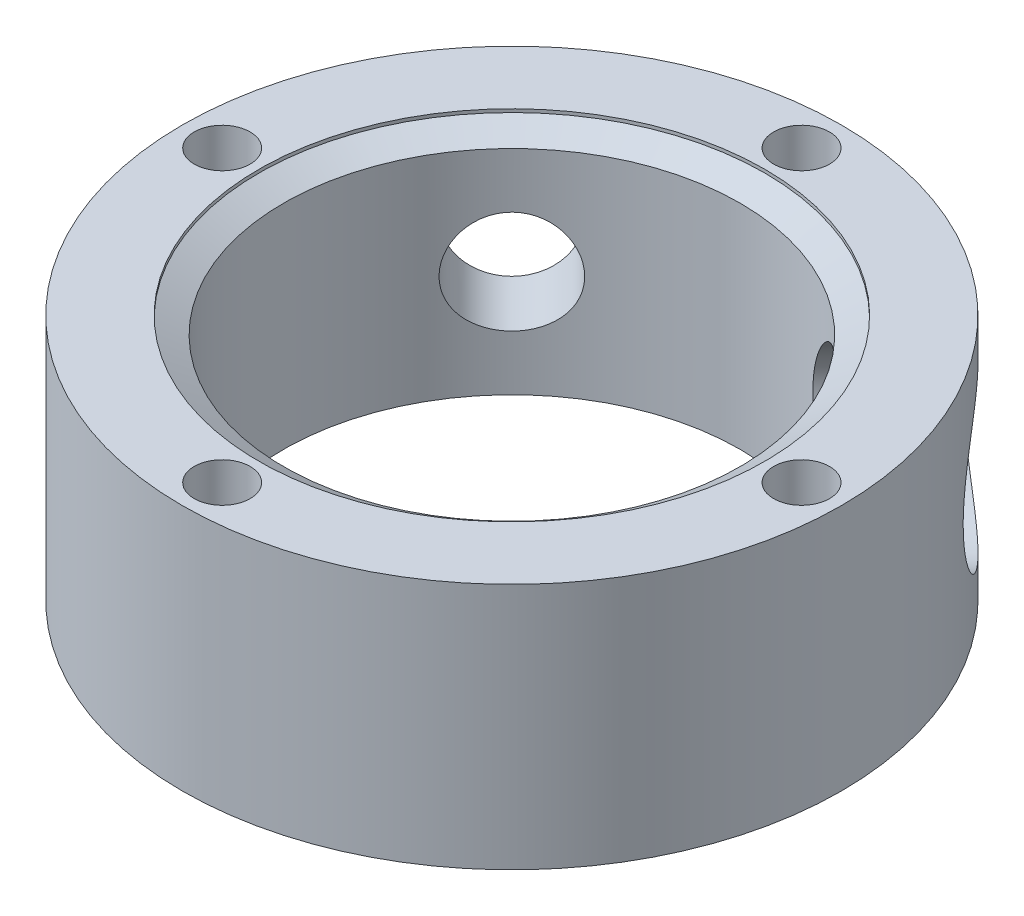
ISO-10303-21;
HEADER;
FILE_DESCRIPTION(('STEP AP214'),'2;1');
FILE_NAME('part.step','',(''),(''),'','','');
FILE_SCHEMA(('AUTOMOTIVE_DESIGN { 1 0 10303 214 1 1 1 1 }'));
ENDSEC;
DATA;
#1=APPLICATION_CONTEXT('core data for automotive mechanical design processes');
#2=APPLICATION_PROTOCOL_DEFINITION('international standard','automotive_design',2000,#1);
#3=PRODUCT_CONTEXT('',#1,'mechanical');
#4=PRODUCT('Part','Part','',(#3));
#5=PRODUCT_RELATED_PRODUCT_CATEGORY('part','',(#4));
#6=PRODUCT_DEFINITION_FORMATION('','',#4);
#7=PRODUCT_DEFINITION_CONTEXT('part definition',#1,'design');
#8=PRODUCT_DEFINITION('design','',#6,#7);
#9=PRODUCT_DEFINITION_SHAPE('','',#8);
#10=(LENGTH_UNIT() NAMED_UNIT(*) SI_UNIT(.MILLI.,.METRE.));
#11=(NAMED_UNIT(*) PLANE_ANGLE_UNIT() SI_UNIT($,.RADIAN.));
#12=(NAMED_UNIT(*) SI_UNIT($,.STERADIAN.) SOLID_ANGLE_UNIT());
#13=UNCERTAINTY_MEASURE_WITH_UNIT(LENGTH_MEASURE(1.E-05),#10,'distance_accuracy_value','');
#14=(GEOMETRIC_REPRESENTATION_CONTEXT(3) GLOBAL_UNCERTAINTY_ASSIGNED_CONTEXT((#13)) GLOBAL_UNIT_ASSIGNED_CONTEXT((#10,
#11,#12)) REPRESENTATION_CONTEXT('',''));
#15=CARTESIAN_POINT('',(0.,0.,0.));
#16=DIRECTION('',(0.,0.,1.));
#17=DIRECTION('',(1.,0.,0.));
#18=AXIS2_PLACEMENT_3D('',#15,#16,#17);
#19=CARTESIAN_POINT('',(0.,0.,0.));
#20=DIRECTION('',(0.,-1.,0.));
#21=DIRECTION('',(0.,0.,-1.));
#22=AXIS2_PLACEMENT_3D('',#19,#20,#21);
#23=CYLINDRICAL_SURFACE('',#22,25.4);
#24=CARTESIAN_POINT('',(21.8803192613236,9.525,-12.9000631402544));
#25=CARTESIAN_POINT('',(21.880320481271,9.34961905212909,-12.9000568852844));
#26=CARTESIAN_POINT('',(21.8765095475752,9.17429549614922,-12.9065303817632));
#27=CARTESIAN_POINT('',(21.8612718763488,8.82487949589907,-12.9323255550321));
#28=CARTESIAN_POINT('',(21.8498442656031,8.65078719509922,-12.9516487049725));
#29=CARTESIAN_POINT('',(21.8193778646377,8.30509654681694,-13.0029084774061));
#30=CARTESIAN_POINT('',(21.8003366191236,8.13349902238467,-13.034849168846));
#31=CARTESIAN_POINT('',(21.7546540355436,7.7939991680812,-13.1109495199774));
#32=CARTESIAN_POINT('',(21.7280098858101,7.62609823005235,-13.1551136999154));
#33=CARTESIAN_POINT('',(21.6672018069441,7.29549960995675,-13.2550283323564));
#34=CARTESIAN_POINT('',(21.6330506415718,7.13279362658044,-13.3107591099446));
#35=CARTESIAN_POINT('',(21.5572219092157,6.81331598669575,-13.433218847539));
#36=CARTESIAN_POINT('',(21.5155415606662,6.65654654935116,-13.4999518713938));
#37=CARTESIAN_POINT('',(21.4247211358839,6.3500785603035,-13.6436263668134));
#38=CARTESIAN_POINT('',(21.3755837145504,6.20037751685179,-13.7205642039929));
#39=CARTESIAN_POINT('',(21.2698730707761,5.90888174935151,-13.8838741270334));
#40=CARTESIAN_POINT('',(21.213297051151,5.7670900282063,-13.9702497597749));
#41=CARTESIAN_POINT('',(21.0916201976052,5.4896820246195,-14.1532987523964));
#42=CARTESIAN_POINT('',(21.0263747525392,5.35423987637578,-14.250139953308));
#43=CARTESIAN_POINT('',(20.888322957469,5.09339008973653,-14.4517435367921));
#44=CARTESIAN_POINT('',(20.8155138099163,4.96798619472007,-14.5565088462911));
#45=CARTESIAN_POINT('',(20.6625168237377,4.72812500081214,-14.7728787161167));
#46=CARTESIAN_POINT('',(20.5823309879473,4.61366474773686,-14.8844814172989));
#47=CARTESIAN_POINT('',(20.4147261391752,4.39638455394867,-15.1135402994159));
#48=CARTESIAN_POINT('',(20.3273044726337,4.2935689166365,-15.230998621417));
#49=CARTESIAN_POINT('',(20.1442535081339,4.09900960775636,-15.4723073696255));
#50=CARTESIAN_POINT('',(20.0485275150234,4.00743849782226,-15.5962236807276));
#51=CARTESIAN_POINT('',(19.8502821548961,3.83773768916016,-15.847773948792));
#52=CARTESIAN_POINT('',(19.7477627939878,3.75960797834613,-15.9754079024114));
#53=CARTESIAN_POINT('',(19.5363898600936,3.6174131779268,-16.2332143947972));
#54=CARTESIAN_POINT('',(19.4275370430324,3.55334641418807,-16.363386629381));
#55=CARTESIAN_POINT('',(19.2040388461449,3.43979390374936,-16.625116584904));
#56=CARTESIAN_POINT('',(19.0893934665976,3.39030815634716,-16.7566743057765));
#57=CARTESIAN_POINT('',(18.8573748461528,3.3072022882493,-17.0173214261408));
#58=CARTESIAN_POINT('',(18.7401052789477,3.27327851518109,-17.146406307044));
#59=CARTESIAN_POINT('',(18.5013397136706,3.22010808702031,-17.40377133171));
#60=CARTESIAN_POINT('',(18.3798422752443,3.20086648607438,-17.5320511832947));
#61=CARTESIAN_POINT('',(18.1335381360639,3.17725869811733,-17.7866839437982));
#62=CARTESIAN_POINT('',(18.008733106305,3.17288513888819,-17.9130377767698));
#63=CARTESIAN_POINT('',(17.7566725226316,3.17901365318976,-18.1629342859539));
#64=CARTESIAN_POINT('',(17.6294160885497,3.18952117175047,-18.2864759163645));
#65=CARTESIAN_POINT('',(17.2512167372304,3.24250269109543,-18.6460201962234));
#66=CARTESIAN_POINT('',(16.9980281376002,3.30590295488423,-18.8769426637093));
#67=CARTESIAN_POINT('',(16.4941104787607,3.48734633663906,-19.3188247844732));
#68=CARTESIAN_POINT('',(16.2433815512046,3.60539236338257,-19.5297833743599));
#69=CARTESIAN_POINT('',(15.7502272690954,3.89382671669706,-19.9296768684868));
#70=CARTESIAN_POINT('',(15.5078974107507,4.06467834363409,-20.1183955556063));
#71=CARTESIAN_POINT('',(15.0423033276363,4.45352337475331,-20.4688590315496));
#72=CARTESIAN_POINT('',(14.8190424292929,4.67152498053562,-20.6305991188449));
#73=CARTESIAN_POINT('',(14.3939181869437,5.1554602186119,-20.9295137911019));
#74=CARTESIAN_POINT('',(14.1927974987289,5.42253143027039,-21.0659050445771));
#75=CARTESIAN_POINT('',(13.8272764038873,5.99338392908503,-21.3076180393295));
#76=CARTESIAN_POINT('',(13.6628777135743,6.2971669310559,-21.4129383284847));
#77=CARTESIAN_POINT('',(13.3774110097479,6.93493668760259,-21.5924425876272));
#78=CARTESIAN_POINT('',(13.2565569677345,7.26906275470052,-21.6664731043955));
#79=CARTESIAN_POINT('',(13.0653249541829,7.95676708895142,-21.7823304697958));
#80=CARTESIAN_POINT('',(12.9949361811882,8.31034117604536,-21.824164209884));
#81=CARTESIAN_POINT('',(12.9095203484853,9.01689713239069,-21.8747961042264));
#82=CARTESIAN_POINT('',(12.8930801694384,9.36964798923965,-21.8844376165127));
#83=CARTESIAN_POINT('',(12.9124524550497,10.0731877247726,-21.8730130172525));
#84=CARTESIAN_POINT('',(12.9482601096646,10.4239767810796,-21.851949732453));
#85=CARTESIAN_POINT('',(13.0692277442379,11.1077102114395,-21.7798085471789));
#86=CARTESIAN_POINT('',(13.1535706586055,11.4408526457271,-21.7292273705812));
#87=CARTESIAN_POINT('',(13.3669122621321,12.0864159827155,-21.5986387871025));
#88=CARTESIAN_POINT('',(13.4959162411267,12.398834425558,-21.5186278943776));
#89=CARTESIAN_POINT('',(13.7958111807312,13.0008405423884,-21.3276277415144));
#90=CARTESIAN_POINT('',(13.967474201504,13.2898601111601,-21.2160615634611));
#91=CARTESIAN_POINT('',(14.3442021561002,13.8307795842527,-20.9631866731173));
#92=CARTESIAN_POINT('',(14.5492725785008,14.0826733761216,-20.8218730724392));
#93=CARTESIAN_POINT('',(14.9904019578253,14.5486356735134,-20.5066603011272));
#94=CARTESIAN_POINT('',(15.2271078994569,14.7616000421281,-20.3320342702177));
#95=CARTESIAN_POINT('',(15.7185719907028,15.1357136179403,-19.9545006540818));
#96=CARTESIAN_POINT('',(15.9733291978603,15.2968655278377,-19.7515945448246));
#97=CARTESIAN_POINT('',(16.3607303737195,15.4953673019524,-19.4297373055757));
#98=CARTESIAN_POINT('',(16.4903260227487,15.5542123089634,-19.3199076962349));
#99=CARTESIAN_POINT('',(16.7504974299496,15.6574324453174,-19.0947725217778));
#100=CARTESIAN_POINT('',(16.8810727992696,15.7018130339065,-18.9794690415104));
#101=CARTESIAN_POINT('',(17.1420899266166,15.7757231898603,-18.7440567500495));
#102=CARTESIAN_POINT('',(17.2725316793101,15.8052521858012,-18.6239477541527));
#103=CARTESIAN_POINT('',(17.5321937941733,15.8492048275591,-18.3797153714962));
#104=CARTESIAN_POINT('',(17.6614142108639,15.8636291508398,-18.2555921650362));
#105=CARTESIAN_POINT('',(17.9141281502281,15.8770594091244,-18.0076234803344));
#106=CARTESIAN_POINT('',(18.0376820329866,15.8764718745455,-17.8838613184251));
#107=CARTESIAN_POINT('',(18.2817590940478,15.860882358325,-17.6342776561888));
#108=CARTESIAN_POINT('',(18.4022823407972,15.8458807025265,-17.5084562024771));
#109=CARTESIAN_POINT('',(18.6395028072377,15.8015868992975,-17.2556941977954));
#110=CARTESIAN_POINT('',(18.7561994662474,15.7722926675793,-17.1287534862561));
#111=CARTESIAN_POINT('',(18.9849837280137,15.6996693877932,-16.8748211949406));
#112=CARTESIAN_POINT('',(19.0970729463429,15.6563453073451,-16.7478296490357));
#113=CARTESIAN_POINT('',(19.3155029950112,15.5562638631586,-16.4954254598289));
#114=CARTESIAN_POINT('',(19.4218700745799,15.4995756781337,-16.3700080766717));
#115=CARTESIAN_POINT('',(19.6289058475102,15.3731085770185,-16.1211738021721));
#116=CARTESIAN_POINT('',(19.7295765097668,15.303334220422,-15.9977562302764));
#117=CARTESIAN_POINT('',(19.9248735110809,15.1511623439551,-15.7538515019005));
#118=CARTESIAN_POINT('',(20.0194971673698,15.068759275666,-15.6333656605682));
#119=CARTESIAN_POINT('',(20.2022769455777,14.8919632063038,-15.3964407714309));
#120=CARTESIAN_POINT('',(20.2904351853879,14.7975741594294,-15.2800004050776));
#121=CARTESIAN_POINT('',(20.4621151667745,14.5949833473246,-15.0493525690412));
#122=CARTESIAN_POINT('',(20.5454719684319,14.4865014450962,-14.9352683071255));
#123=CARTESIAN_POINT('',(20.7049068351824,14.2583780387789,-14.7134458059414));
#124=CARTESIAN_POINT('',(20.7809873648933,14.1387403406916,-14.6057054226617));
#125=CARTESIAN_POINT('',(20.9257837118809,13.8889854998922,-14.3974883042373));
#126=CARTESIAN_POINT('',(20.9944950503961,13.7588620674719,-14.2970159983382));
#127=CARTESIAN_POINT('',(21.1243566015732,13.4890913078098,-14.1044335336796));
#128=CARTESIAN_POINT('',(21.1855095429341,13.3494474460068,-14.012320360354));
#129=CARTESIAN_POINT('',(21.3012912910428,13.0587410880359,-13.8356914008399));
#130=CARTESIAN_POINT('',(21.3557733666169,12.9075115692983,-13.7513540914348));
#131=CARTESIAN_POINT('',(21.4567367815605,12.5971297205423,-13.593279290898));
#132=CARTESIAN_POINT('',(21.5032210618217,12.4379803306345,-13.5195379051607));
#133=CARTESIAN_POINT('',(21.5881443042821,12.1128616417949,-13.3835145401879));
#134=CARTESIAN_POINT('',(21.6265868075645,11.9468953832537,-13.3212275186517));
#135=CARTESIAN_POINT('',(21.6954022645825,11.6093150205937,-13.2088547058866));
#136=CARTESIAN_POINT('',(21.7257764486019,11.4377017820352,-13.1587670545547));
#137=CARTESIAN_POINT('',(21.7947922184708,10.98197875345,-13.0443093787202));
#138=CARTESIAN_POINT('',(21.8268650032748,10.6941532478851,-12.9903684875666));
#139=CARTESIAN_POINT('',(21.8696265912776,10.1124978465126,-12.9182521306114));
#140=CARTESIAN_POINT('',(21.8803172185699,9.81866846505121,-12.9000736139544));
#141=CARTESIAN_POINT('',(21.8803192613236,9.525,-12.9000631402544));
#142=B_SPLINE_CURVE_WITH_KNOTS('',3,(#24,#25,#26,#27,#28,#29,#30,#31,#32,#33,#34,#35,#36,#37,
#38,#39,#40,#41,#42,#43,#44,#45,#46,#47,#48,#49,#50,#51,#52,#53,#54,#55,#56,#57,#58,#59,#60,#61,
#62,#63,#64,#65,#66,#67,#68,#69,#70,#71,#72,#73,#74,#75,#76,#77,#78,#79,#80,#81,#82,#83,#84,#85,
#86,#87,#88,#89,#90,#91,#92,#93,#94,#95,#96,#97,#98,#99,#100,#101,#102,#103,#104,#105,#106,#107,
#108,#109,#110,#111,#112,#113,#114,#115,#116,#117,#118,#119,#120,#121,#122,#123,#124,#125,#126,
#127,#128,#129,#130,#131,#132,#133,#134,#135,#136,#137,#138,#139,#140,#141),.UNSPECIFIED.,.T.,
.F.,(4,2,2,2,2,2,2,2,2,2,2,2,2,2,2,2,2,2,2,2,2,2,2,2,2,2,2,2,2,2,2,2,2,2,2,2,2,2,2,2,2,2,2,2,2,
2,2,2,2,2,2,2,2,2,2,2,2,2,4),(0.,0.525883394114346,1.05182708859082,1.577940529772,
2.1042487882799,2.62966902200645,3.15528376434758,3.68071181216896,4.20633800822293,
4.74220479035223,5.27827048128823,5.8141910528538,6.35030903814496,6.8938327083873,
7.43735588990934,7.98081433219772,8.52427274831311,9.05662154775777,9.58915351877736,
10.1214213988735,10.6538840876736,11.6940169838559,12.7342052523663,13.7837921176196,
14.8335617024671,15.9117429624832,16.9899746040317,18.0734344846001,19.1566623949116,
20.2112799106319,21.2658003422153,22.3030671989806,23.3404569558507,24.3981973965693,
25.4561117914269,26.5404965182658,27.6248246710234,28.163611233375,28.7021942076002,
29.2407979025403,29.7793774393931,30.3033877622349,30.8273862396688,31.3514611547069,
31.8753507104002,32.396585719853,32.9176394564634,33.4389227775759,33.9600345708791,
34.4938220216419,35.0274280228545,35.5613565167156,36.0950916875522,36.639009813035,
37.1827275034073,37.7262052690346,38.2696001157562,39.1502462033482,40.0308171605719),.UNSPECIFIED.);
#143=CARTESIAN_POINT('',(21.8803192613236,9.525,-12.9000631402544));
#144=VERTEX_POINT('',#143);
#145=EDGE_CURVE('E118',#144,#144,#142,.T.);
#146=ORIENTED_EDGE('',*,*,#145,.F.);
#147=EDGE_LOOP('',(#146));
#148=FACE_BOUND('',#147,.T.);
#149=CARTESIAN_POINT('',(0.,19.05,0.));
#150=DIRECTION('',(0.,-1.,0.));
#151=DIRECTION('',(0.,0.,-1.));
#152=AXIS2_PLACEMENT_3D('',#149,#150,#151);
#153=CIRCLE('',#152,25.4);
#154=CARTESIAN_POINT('',(0.,19.05,-25.4));
#155=VERTEX_POINT('',#154);
#156=EDGE_CURVE('E148',#155,#155,#153,.T.);
#157=ORIENTED_EDGE('',*,*,#156,.T.);
#158=EDGE_LOOP('',(#157));
#159=FACE_BOUND('',#158,.T.);
#160=CARTESIAN_POINT('',(0.,0.,0.));
#161=DIRECTION('',(0.,-1.,0.));
#162=DIRECTION('',(0.,0.,-1.));
#163=AXIS2_PLACEMENT_3D('',#160,#161,#162);
#164=CIRCLE('',#163,25.4);
#165=CARTESIAN_POINT('',(0.,0.,-25.4));
#166=VERTEX_POINT('',#165);
#167=EDGE_CURVE('E74',#166,#166,#164,.T.);
#168=ORIENTED_EDGE('',*,*,#167,.F.);
#169=EDGE_LOOP('',(#168));
#170=FACE_BOUND('',#169,.T.);
#171=DIRECTION('',(0.,-1.,0.));
#172=VECTOR('',#171,1.);
#173=CARTESIAN_POINT('',(-13.0554080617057,0.,-21.7879856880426));
#174=LINE('',#173,#172);
#175=CARTESIAN_POINT('',(-13.0554080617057,15.6994218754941,-21.7879856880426));
#176=VERTEX_POINT('',#175);
#177=CARTESIAN_POINT('',(-13.0554080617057,2.9083087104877,-21.7879856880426));
#178=VERTEX_POINT('',#177);
#179=EDGE_CURVE('E70',#176,#178,#174,.T.);
#180=ORIENTED_EDGE('',*,*,#179,.F.);
#181=CARTESIAN_POINT('',(-13.0554080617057,15.6994218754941,-21.7879856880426));
#182=CARTESIAN_POINT('',(-13.2122135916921,15.8706312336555,-21.6940407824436));
#183=CARTESIAN_POINT('',(-13.3739141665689,16.0344843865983,-21.5948367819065));
#184=CARTESIAN_POINT('',(-13.7055162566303,16.3464991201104,-21.3859083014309));
#185=CARTESIAN_POINT('',(-13.875419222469,16.4946579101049,-21.2761819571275));
#186=CARTESIAN_POINT('',(-14.2220467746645,16.7744584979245,-21.0460628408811));
#187=CARTESIAN_POINT('',(-14.3987814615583,16.9060745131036,-20.9256539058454));
#188=CARTESIAN_POINT('',(-14.7571479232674,17.1515489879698,-20.6744877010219));
#189=CARTESIAN_POINT('',(-14.9387793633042,17.26540865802,-20.5437311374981));
#190=CARTESIAN_POINT('',(-15.3055957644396,17.4746624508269,-20.2719248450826));
#191=CARTESIAN_POINT('',(-15.490786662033,17.5700221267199,-20.1308565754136));
#192=CARTESIAN_POINT('',(-15.8626615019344,17.7411774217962,-19.8391482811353));
#193=CARTESIAN_POINT('',(-16.0493453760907,17.8169739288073,-19.6885086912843));
#194=CARTESIAN_POINT('',(-16.4222844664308,17.9482247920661,-19.3785267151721));
#195=CARTESIAN_POINT('',(-16.6085399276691,18.003700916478,-19.2191938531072));
#196=CARTESIAN_POINT('',(-16.9791206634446,18.0938694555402,-18.8926029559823));
#197=CARTESIAN_POINT('',(-17.1634460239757,18.1285628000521,-18.7253452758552));
#198=CARTESIAN_POINT('',(-17.5216889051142,18.1759035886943,-18.390439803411));
#199=CARTESIAN_POINT('',(-17.6957375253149,18.1893288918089,-18.2230417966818));
#200=CARTESIAN_POINT('',(-18.0391796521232,18.1964635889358,-17.8831307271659));
#201=CARTESIAN_POINT('',(-18.2085732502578,18.1901733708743,-17.7106177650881));
#202=CARTESIAN_POINT('',(-18.5415104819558,18.1579361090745,-17.3617552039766));
#203=CARTESIAN_POINT('',(-18.7050528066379,18.1319846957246,-17.1854047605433));
#204=CARTESIAN_POINT('',(-19.0251706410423,18.0606737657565,-16.8303304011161));
#205=CARTESIAN_POINT('',(-19.1817462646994,18.0153145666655,-16.6516065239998));
#206=CARTESIAN_POINT('',(-19.4838332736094,17.9067665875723,-16.2970350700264));
#207=CARTESIAN_POINT('',(-19.6295077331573,17.8439712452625,-16.1212056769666));
#208=CARTESIAN_POINT('',(-19.9126530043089,17.7007267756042,-15.7701336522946));
#209=CARTESIAN_POINT('',(-20.0501235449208,17.6202770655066,-15.5948910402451));
#210=CARTESIAN_POINT('',(-20.3163494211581,17.4423695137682,-15.2464425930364));
#211=CARTESIAN_POINT('',(-20.4451051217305,17.3449123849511,-15.0732366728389));
#212=CARTESIAN_POINT('',(-20.693519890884,17.1337603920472,-14.7303458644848));
#213=CARTESIAN_POINT('',(-20.8131805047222,17.0200682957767,-14.5606603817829));
#214=CARTESIAN_POINT('',(-21.0901421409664,16.7276430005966,-14.1579453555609));
#215=CARTESIAN_POINT('',(-21.2429242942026,16.5412788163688,-13.9272641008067));
#216=CARTESIAN_POINT('',(-21.4579162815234,16.2407687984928,-13.5917438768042));
#217=CARTESIAN_POINT('',(-21.5271638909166,16.1372017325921,-13.481743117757));
#218=CARTESIAN_POINT('',(-21.6610303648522,15.9233150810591,-13.2655908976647));
#219=CARTESIAN_POINT('',(-21.7256498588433,15.8129964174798,-13.1594389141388));
#220=CARTESIAN_POINT('',(-21.7879856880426,15.6994218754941,-13.0554080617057));
#221=B_SPLINE_CURVE_WITH_KNOTS('',3,(#181,#182,#183,#184,#185,#186,#187,#188,#189,#190,#191,
#192,#193,#194,#195,#196,#197,#198,#199,#200,#201,#202,#203,#204,#205,#206,#207,#208,#209,#210,
#211,#212,#213,#214,#215,#216,#217,#218,#219,#220),.UNSPECIFIED.,.F.,.F.,(4,2,2,2,2,2,2,2,2,2,2,
2,2,2,2,2,2,2,2,4),(0.,0.751161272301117,1.50245588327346,2.25490727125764,3.00730734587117,
3.76109521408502,4.51484886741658,5.2677926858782,6.02070281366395,6.74538170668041,
7.47004634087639,8.19487207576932,8.9196859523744,9.62931498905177,10.3389674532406,
11.0485901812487,11.758092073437,12.7565612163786,13.2549493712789,13.7532696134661),.UNSPECIFIED.);
#222=CARTESIAN_POINT('',(-21.7879856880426,15.6994218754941,-13.0554080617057));
#223=VERTEX_POINT('',#222);
#224=EDGE_CURVE('E48',#176,#223,#221,.T.);
#225=ORIENTED_EDGE('',*,*,#224,.T.);
#226=DIRECTION('',(0.,-1.,0.));
#227=VECTOR('',#226,1.);
#228=CARTESIAN_POINT('',(-21.7879856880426,0.,-13.0554080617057));
#229=LINE('',#228,#227);
#230=CARTESIAN_POINT('',(-21.7879856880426,2.90830871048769,-13.0554080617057));
#231=VERTEX_POINT('',#230);
#232=EDGE_CURVE('E64',#231,#223,#229,.F.);
#233=ORIENTED_EDGE('',*,*,#232,.F.);
#234=CARTESIAN_POINT('',(-21.7879856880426,2.9083087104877,-13.0554080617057));
#235=CARTESIAN_POINT('',(-21.6940407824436,2.73709935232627,-13.2122135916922));
#236=CARTESIAN_POINT('',(-21.5948367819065,2.57324619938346,-13.3739141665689));
#237=CARTESIAN_POINT('',(-21.3859083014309,2.26123146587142,-13.7055162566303));
#238=CARTESIAN_POINT('',(-21.2761819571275,2.1130726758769,-13.8754192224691));
#239=CARTESIAN_POINT('',(-21.046062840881,1.83327208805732,-14.2220467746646));
#240=CARTESIAN_POINT('',(-20.9256539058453,1.70165607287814,-14.3987814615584));
#241=CARTESIAN_POINT('',(-20.6744877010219,1.45618159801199,-14.7571479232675));
#242=CARTESIAN_POINT('',(-20.543731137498,1.34232192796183,-14.9387793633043));
#243=CARTESIAN_POINT('',(-20.2719248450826,1.13306813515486,-15.3055957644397));
#244=CARTESIAN_POINT('',(-20.1308565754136,1.03770845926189,-15.4907866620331));
#245=CARTESIAN_POINT('',(-19.8391482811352,0.866553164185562,-15.8626615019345));
#246=CARTESIAN_POINT('',(-19.6885086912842,0.79075665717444,-16.0493453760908));
#247=CARTESIAN_POINT('',(-19.378526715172,0.65950579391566,-16.4222844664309));
#248=CARTESIAN_POINT('',(-19.2191938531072,0.604029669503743,-16.6085399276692));
#249=CARTESIAN_POINT('',(-18.8926029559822,0.513861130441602,-16.9791206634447));
#250=CARTESIAN_POINT('',(-18.7253452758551,0.479167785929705,-17.1634460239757));
#251=CARTESIAN_POINT('',(-18.3904398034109,0.431826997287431,-17.5216889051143));
#252=CARTESIAN_POINT('',(-18.2230417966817,0.418401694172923,-17.6957375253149));
#253=CARTESIAN_POINT('',(-17.8831307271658,0.411266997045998,-18.0391796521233));
#254=CARTESIAN_POINT('',(-17.7106177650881,0.417557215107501,-18.2085732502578));
#255=CARTESIAN_POINT('',(-17.3617552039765,0.449794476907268,-18.5415104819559));
#256=CARTESIAN_POINT('',(-17.1854047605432,0.475745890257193,-18.7050528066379));
#257=CARTESIAN_POINT('',(-16.830330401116,0.547056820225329,-19.0251706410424));
#258=CARTESIAN_POINT('',(-16.6516065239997,0.592416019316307,-19.1817462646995));
#259=CARTESIAN_POINT('',(-16.2970350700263,0.700963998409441,-19.4838332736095));
#260=CARTESIAN_POINT('',(-16.1212056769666,0.763759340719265,-19.6295077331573));
#261=CARTESIAN_POINT('',(-15.7701336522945,0.907003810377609,-19.912653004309));
#262=CARTESIAN_POINT('',(-15.594891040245,0.98745352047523,-20.0501235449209));
#263=CARTESIAN_POINT('',(-15.2464425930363,1.16536107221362,-20.3163494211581));
#264=CARTESIAN_POINT('',(-15.0732366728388,1.26281820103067,-20.4451051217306));
#265=CARTESIAN_POINT('',(-14.7303458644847,1.47397019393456,-20.693519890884));
#266=CARTESIAN_POINT('',(-14.5606603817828,1.58766229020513,-20.8131805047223));
#267=CARTESIAN_POINT('',(-14.1579453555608,1.88008758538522,-21.0901421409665));
#268=CARTESIAN_POINT('',(-13.9272641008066,2.06645176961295,-21.2429242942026));
#269=CARTESIAN_POINT('',(-13.5917438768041,2.36696178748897,-21.4579162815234));
#270=CARTESIAN_POINT('',(-13.4817431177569,2.47052885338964,-21.5271638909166));
#271=CARTESIAN_POINT('',(-13.2655908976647,2.68441550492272,-21.6610303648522));
#272=CARTESIAN_POINT('',(-13.1594389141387,2.794734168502,-21.7256498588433));
#273=CARTESIAN_POINT('',(-13.0554080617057,2.9083087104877,-21.7879856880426));
#274=B_SPLINE_CURVE_WITH_KNOTS('',3,(#234,#235,#236,#237,#238,#239,#240,#241,#242,#243,#244,
#245,#246,#247,#248,#249,#250,#251,#252,#253,#254,#255,#256,#257,#258,#259,#260,#261,#262,#263,
#264,#265,#266,#267,#268,#269,#270,#271,#272,#273),.UNSPECIFIED.,.F.,.F.,(4,2,2,2,2,2,2,2,2,2,2,
2,2,2,2,2,2,2,2,4),(0.,0.751161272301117,1.50245588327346,2.25490727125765,3.00730734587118,
3.76109521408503,4.51484886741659,5.26779268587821,6.02070281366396,6.74538170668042,
7.47004634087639,8.19487207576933,8.91968595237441,9.62931498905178,10.3389674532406,
11.0485901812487,11.758092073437,12.7565612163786,13.2549493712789,13.7532696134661),.UNSPECIFIED.);
#275=EDGE_CURVE('E56',#231,#178,#274,.T.);
#276=ORIENTED_EDGE('',*,*,#275,.T.);
#277=EDGE_LOOP('',(#180,#225,#233,#276));
#278=FACE_BOUND('',#277,.T.);
#279=ADVANCED_FACE('F34',(#148,#159,#170,#278),#23,.T.);
#280=CARTESIAN_POINT('',(19.4945,0.,0.));
#281=DIRECTION('',(0.,-1.,0.));
#282=DIRECTION('',(0.,0.,-1.));
#283=AXIS2_PLACEMENT_3D('',#280,#281,#282);
#284=PLANE('',#283);
#285=CARTESIAN_POINT('',(0.,0.,22.32406));
#286=DIRECTION('',(0.,-1.,0.));
#287=DIRECTION('',(0.,0.,1.));
#288=AXIS2_PLACEMENT_3D('',#285,#286,#287);
#289=CIRCLE('',#288,2.15265);
#290=CARTESIAN_POINT('',(0.,0.,20.17141));
#291=VERTEX_POINT('',#290);
#292=EDGE_CURVE('E123',#291,#291,#289,.T.);
#293=ORIENTED_EDGE('',*,*,#292,.F.);
#294=EDGE_LOOP('',(#293));
#295=FACE_BOUND('',#294,.T.);
#296=CARTESIAN_POINT('',(-22.32406,0.,0.));
#297=DIRECTION('',(0.,-1.,0.));
#298=DIRECTION('',(0.,0.,1.));
#299=AXIS2_PLACEMENT_3D('',#296,#297,#298);
#300=CIRCLE('',#299,2.15265);
#301=CARTESIAN_POINT('',(-22.32406,0.,-2.15265000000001));
#302=VERTEX_POINT('',#301);
#303=EDGE_CURVE('E130',#302,#302,#300,.T.);
#304=ORIENTED_EDGE('',*,*,#303,.F.);
#305=EDGE_LOOP('',(#304));
#306=FACE_BOUND('',#305,.T.);
#307=CARTESIAN_POINT('',(22.32406,0.,0.));
#308=DIRECTION('',(0.,-1.,0.));
#309=DIRECTION('',(0.,0.,-1.));
#310=AXIS2_PLACEMENT_3D('',#307,#308,#309);
#311=CIRCLE('',#310,2.15265);
#312=CARTESIAN_POINT('',(22.32406,0.,-2.15265));
#313=VERTEX_POINT('',#312);
#314=EDGE_CURVE('E136',#313,#313,#311,.T.);
#315=ORIENTED_EDGE('',*,*,#314,.F.);
#316=EDGE_LOOP('',(#315));
#317=FACE_BOUND('',#316,.T.);
#318=CARTESIAN_POINT('',(0.,0.,-22.32406));
#319=DIRECTION('',(0.,-1.,0.));
#320=DIRECTION('',(0.,0.,-1.));
#321=AXIS2_PLACEMENT_3D('',#318,#319,#320);
#322=CIRCLE('',#321,2.15265);
#323=CARTESIAN_POINT('',(0.,0.,-24.47671));
#324=VERTEX_POINT('',#323);
#325=EDGE_CURVE('E142',#324,#324,#322,.T.);
#326=ORIENTED_EDGE('',*,*,#325,.F.);
#327=EDGE_LOOP('',(#326));
#328=FACE_BOUND('',#327,.T.);
#329=ORIENTED_EDGE('',*,*,#167,.T.);
#330=EDGE_LOOP('',(#329));
#331=FACE_BOUND('',#330,.T.);
#332=CARTESIAN_POINT('',(0.,0.,0.));
#333=DIRECTION('',(0.,-1.,0.));
#334=DIRECTION('',(0.,0.,-1.));
#335=AXIS2_PLACEMENT_3D('',#332,#333,#334);
#336=CIRCLE('',#335,19.4945);
#337=CARTESIAN_POINT('',(0.,0.,-19.4945));
#338=VERTEX_POINT('',#337);
#339=EDGE_CURVE('E78',#338,#338,#336,.T.);
#340=ORIENTED_EDGE('',*,*,#339,.F.);
#341=EDGE_LOOP('',(#340));
#342=FACE_BOUND('',#341,.T.);
#343=ADVANCED_FACE('F172',(#295,#306,#317,#328,#331,#342),#284,.T.);
#344=CARTESIAN_POINT('',(0.,0.,0.));
#345=DIRECTION('',(0.,-1.,0.));
#346=DIRECTION('',(0.,0.,-1.));
#347=AXIS2_PLACEMENT_3D('',#344,#345,#346);
#348=CYLINDRICAL_SURFACE('',#347,19.4945);
#349=ORIENTED_EDGE('',*,*,#339,.T.);
#350=EDGE_LOOP('',(#349));
#351=FACE_BOUND('',#350,.T.);
#352=CARTESIAN_POINT('',(0.,0.254000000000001,0.));
#353=DIRECTION('',(0.,-1.,0.));
#354=DIRECTION('',(0.,0.,-1.));
#355=AXIS2_PLACEMENT_3D('',#352,#353,#354);
#356=CIRCLE('',#355,19.4945);
#357=CARTESIAN_POINT('',(0.,0.254000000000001,-19.4945));
#358=VERTEX_POINT('',#357);
#359=EDGE_CURVE('E163',#358,#358,#356,.T.);
#360=ORIENTED_EDGE('',*,*,#359,.F.);
#361=EDGE_LOOP('',(#360));
#362=FACE_BOUND('',#361,.T.);
#363=ADVANCED_FACE('F169',(#351,#362),#348,.F.);
#364=CARTESIAN_POINT('',(0.,1.3081,0.));
#365=DIRECTION('',(0.,-1.,0.));
#366=DIRECTION('',(0.,0.,-1.));
#367=AXIS2_PLACEMENT_3D('',#364,#365,#366);
#368=CONICAL_SURFACE('',#367,17.5895,1.06539753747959);
#369=ORIENTED_EDGE('',*,*,#359,.T.);
#370=EDGE_LOOP('',(#369));
#371=FACE_BOUND('',#370,.T.);
#372=CARTESIAN_POINT('',(0.,1.3081,0.));
#373=DIRECTION('',(0.,-1.,0.));
#374=DIRECTION('',(0.,0.,-1.));
#375=AXIS2_PLACEMENT_3D('',#372,#373,#374);
#376=CIRCLE('',#375,17.5895);
#377=CARTESIAN_POINT('',(0.,1.3081,-17.5895));
#378=VERTEX_POINT('',#377);
#379=EDGE_CURVE('E160',#378,#378,#376,.T.);
#380=ORIENTED_EDGE('',*,*,#379,.F.);
#381=EDGE_LOOP('',(#380));
#382=FACE_BOUND('',#381,.T.);
#383=ADVANCED_FACE('F179',(#371,#382),#368,.F.);
#384=CARTESIAN_POINT('',(0.,0.,0.));
#385=DIRECTION('',(0.,-1.,0.));
#386=DIRECTION('',(0.,0.,-1.));
#387=AXIS2_PLACEMENT_3D('',#384,#385,#386);
#388=CYLINDRICAL_SURFACE('',#387,17.5895);
#389=CARTESIAN_POINT('',(-9.31059064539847,9.525,-14.9232507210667));
#390=CARTESIAN_POINT('',(-9.31059895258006,9.74486018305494,-14.9232486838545));
#391=CARTESIAN_POINT('',(-9.32657781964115,9.96480673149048,-14.9133127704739));
#392=CARTESIAN_POINT('',(-9.38973837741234,10.3984321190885,-14.8736231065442));
#393=CARTESIAN_POINT('',(-9.43694169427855,10.6121065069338,-14.8438556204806));
#394=CARTESIAN_POINT('',(-9.5602336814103,11.0268524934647,-14.7647473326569));
#395=CARTESIAN_POINT('',(-9.63628949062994,11.2279381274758,-14.7154287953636));
#396=CARTESIAN_POINT('',(-9.81391422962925,11.6123904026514,-14.5975651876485));
#397=CARTESIAN_POINT('',(-9.91548297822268,11.7957571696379,-14.5290202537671));
#398=CARTESIAN_POINT('',(-10.1418195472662,12.1428623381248,-14.371960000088));
#399=CARTESIAN_POINT('',(-10.2669355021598,12.3062359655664,-14.283140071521));
#400=CARTESIAN_POINT('',(-10.534390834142,12.6055186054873,-14.0870355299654));
#401=CARTESIAN_POINT('',(-10.6767316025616,12.7414253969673,-13.9797494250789));
#402=CARTESIAN_POINT('',(-10.9750939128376,12.9833698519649,-13.7467811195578));
#403=CARTESIAN_POINT('',(-11.1312510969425,13.0890550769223,-13.6209059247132));
#404=CARTESIAN_POINT('',(-11.4502116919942,13.2652738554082,-13.3538893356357));
#405=CARTESIAN_POINT('',(-11.6130143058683,13.3358116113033,-13.2127497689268));
#406=CARTESIAN_POINT('',(-11.9368940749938,13.438581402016,-12.9208276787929));
#407=CARTESIAN_POINT('',(-12.0979548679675,13.4714312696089,-12.7702446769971));
#408=CARTESIAN_POINT('',(-12.4158869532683,13.4998261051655,-12.4613545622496));
#409=CARTESIAN_POINT('',(-12.5727587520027,13.4953756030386,-12.3030483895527));
#410=CARTESIAN_POINT('',(-12.874974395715,13.4497528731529,-11.9863512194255));
#411=CARTESIAN_POINT('',(-13.0204755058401,13.4092467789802,-11.8280136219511));
#412=CARTESIAN_POINT('',(-13.2994928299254,13.2937261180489,-11.5133939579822));
#413=CARTESIAN_POINT('',(-13.4330084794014,13.2187099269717,-11.3571119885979));
#414=CARTESIAN_POINT('',(-13.6863466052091,13.0357199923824,-11.0505345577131));
#415=CARTESIAN_POINT('',(-13.8060557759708,12.9274970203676,-10.9002944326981));
#416=CARTESIAN_POINT('',(-14.0287039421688,12.6813520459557,-10.6122180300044));
#417=CARTESIAN_POINT('',(-14.1316405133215,12.5434257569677,-10.4743835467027));
#418=CARTESIAN_POINT('',(-14.3215891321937,12.2381740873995,-10.2131919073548));
#419=CARTESIAN_POINT('',(-14.4081984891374,12.0702658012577,-10.090222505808));
#420=CARTESIAN_POINT('',(-14.5617812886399,11.7117131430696,-9.86729018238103));
#421=CARTESIAN_POINT('',(-14.628754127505,11.5210680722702,-9.76732796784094));
#422=CARTESIAN_POINT('',(-14.7427322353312,11.1215098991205,-9.59443409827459));
#423=CARTESIAN_POINT('',(-14.7896704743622,10.9125382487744,-9.5215932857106));
#424=CARTESIAN_POINT('',(-14.8629033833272,10.4828154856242,-9.40687481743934));
#425=CARTESIAN_POINT('',(-14.8892015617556,10.2620663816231,-9.36499189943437));
#426=CARTESIAN_POINT('',(-14.9206270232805,9.82017823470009,-9.31484109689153));
#427=CARTESIAN_POINT('',(-14.9262005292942,9.59915120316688,-9.30586476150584));
#428=CARTESIAN_POINT('',(-14.9173751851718,9.15854006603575,-9.32000513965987));
#429=CARTESIAN_POINT('',(-14.9029778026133,8.93895585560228,-9.34311949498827));
#430=CARTESIAN_POINT('',(-14.8546298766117,8.51034561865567,-9.41979146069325));
#431=CARTESIAN_POINT('',(-14.8209309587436,8.30122067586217,-9.47295718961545));
#432=CARTESIAN_POINT('',(-14.7344022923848,7.89623112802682,-9.6069882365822));
#433=CARTESIAN_POINT('',(-14.6815706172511,7.70036786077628,-9.6878563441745));
#434=CARTESIAN_POINT('',(-14.5561215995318,7.3239436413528,-9.87535905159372));
#435=CARTESIAN_POINT('',(-14.4831958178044,7.14368411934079,-9.9823921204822));
#436=CARTESIAN_POINT('',(-14.3185335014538,6.80677752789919,-10.2171729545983));
#437=CARTESIAN_POINT('',(-14.2267944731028,6.65013359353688,-10.3449234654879));
#438=CARTESIAN_POINT('',(-14.0234064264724,6.36170669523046,-10.6190503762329));
#439=CARTESIAN_POINT('',(-13.9113966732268,6.23048213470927,-10.7657475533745));
#440=CARTESIAN_POINT('',(-13.6703188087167,6.00062511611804,-11.0702551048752));
#441=CARTESIAN_POINT('',(-13.5412515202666,5.90199108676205,-11.2280649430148));
#442=CARTESIAN_POINT('',(-13.2693481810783,5.74087820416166,-11.5481021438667));
#443=CARTESIAN_POINT('',(-13.1266098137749,5.67816235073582,-11.7102929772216));
#444=CARTESIAN_POINT('',(-12.8299626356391,5.58993101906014,-12.0345672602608));
#445=CARTESIAN_POINT('',(-12.6760555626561,5.56440976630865,-12.1966507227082));
#446=CARTESIAN_POINT('',(-12.3648070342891,5.5515655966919,-12.5119968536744));
#447=CARTESIAN_POINT('',(-12.2076166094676,5.56341110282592,-12.665375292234));
#448=CARTESIAN_POINT('',(-11.8912919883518,5.62309477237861,-12.9628249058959));
#449=CARTESIAN_POINT('',(-11.7321578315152,5.67093220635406,-13.1068962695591));
#450=CARTESIAN_POINT('',(-11.4175965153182,5.8008326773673,-13.3817978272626));
#451=CARTESIAN_POINT('',(-11.262157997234,5.88277085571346,-13.5126741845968));
#452=CARTESIAN_POINT('',(-10.9594988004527,6.0784277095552,-13.7592896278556));
#453=CARTESIAN_POINT('',(-10.8122789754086,6.19214967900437,-13.875027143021));
#454=CARTESIAN_POINT('',(-10.5282560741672,6.45082072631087,-14.0918035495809));
#455=CARTESIAN_POINT('',(-10.391721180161,6.59635042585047,-14.192501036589));
#456=CARTESIAN_POINT('',(-10.1374711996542,6.91334373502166,-14.3752132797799));
#457=CARTESIAN_POINT('',(-10.0197606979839,7.08481364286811,-14.4572234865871));
#458=CARTESIAN_POINT('',(-9.80633188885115,7.45179752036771,-14.6028539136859));
#459=CARTESIAN_POINT('',(-9.7109555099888,7.64762279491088,-14.6661916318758));
#460=CARTESIAN_POINT('',(-9.54871992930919,8.0558290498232,-14.7723365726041));
#461=CARTESIAN_POINT('',(-9.48183728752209,8.26819625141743,-14.815160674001));
#462=CARTESIAN_POINT('',(-9.3911190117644,8.65472203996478,-14.8727791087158));
#463=CARTESIAN_POINT('',(-9.3610076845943,8.82683084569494,-14.891695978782));
#464=CARTESIAN_POINT('',(-9.32074073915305,9.17427489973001,-14.9169322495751));
#465=CARTESIAN_POINT('',(-9.31058401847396,9.34960996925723,-14.923252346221));
#466=CARTESIAN_POINT('',(-9.31059064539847,9.525,-14.9232507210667));
#467=B_SPLINE_CURVE_WITH_KNOTS('',3,(#389,#390,#391,#392,#393,#394,#395,#396,#397,#398,#399,
#400,#401,#402,#403,#404,#405,#406,#407,#408,#409,#410,#411,#412,#413,#414,#415,#416,#417,#418,
#419,#420,#421,#422,#423,#424,#425,#426,#427,#428,#429,#430,#431,#432,#433,#434,#435,#436,#437,
#438,#439,#440,#441,#442,#443,#444,#445,#446,#447,#448,#449,#450,#451,#452,#453,#454,#455,#456,
#457,#458,#459,#460,#461,#462,#463,#464,#465,#466),.UNSPECIFIED.,.T.,.F.,(4,2,2,2,2,2,2,2,2,2,2,
2,2,2,2,2,2,2,2,2,2,2,2,2,2,2,2,2,2,2,2,2,2,2,2,2,2,2,4),(0.,0.658937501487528,1.31833186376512,
1.97697746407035,2.63561838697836,3.30489506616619,3.97422584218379,4.65107053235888,
5.3278342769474,5.9933374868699,6.65875987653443,7.31213789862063,7.96554667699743,
8.62398471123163,9.28251783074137,9.95562008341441,10.6287430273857,11.3041007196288,
11.9793435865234,12.6399607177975,13.3005293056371,13.9526762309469,14.6048888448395,
15.2677314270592,15.9306619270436,16.6068196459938,17.2829447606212,17.9545555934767,
18.6260621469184,19.2827309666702,19.9393864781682,20.5936585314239,21.2479984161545,
21.915463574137,22.5830910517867,23.2603542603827,23.9370592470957,24.4627454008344,
24.9884025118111),.UNSPECIFIED.);
#468=CARTESIAN_POINT('',(-9.31059064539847,9.525,-14.9232507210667));
#469=VERTEX_POINT('',#468);
#470=EDGE_CURVE('E69',#469,#469,#467,.T.);
#471=ORIENTED_EDGE('',*,*,#470,.F.);
#472=EDGE_LOOP('',(#471));
#473=FACE_BOUND('',#472,.T.);
#474=CARTESIAN_POINT('',(16.0890075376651,9.525,-7.10875141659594));
#475=CARTESIAN_POINT('',(16.0890075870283,9.69694172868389,-7.10875069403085));
#476=CARTESIAN_POINT('',(16.0859821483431,9.86887578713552,-7.11561037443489));
#477=CARTESIAN_POINT('',(16.0738669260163,10.2115043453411,-7.14293613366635));
#478=CARTESIAN_POINT('',(16.0647750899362,10.3821984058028,-7.16340681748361));
#479=CARTESIAN_POINT('',(16.0404949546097,10.7209560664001,-7.21761110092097));
#480=CARTESIAN_POINT('',(16.0253089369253,10.8890206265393,-7.25133973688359));
#481=CARTESIAN_POINT('',(15.9887760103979,11.2214625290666,-7.33154084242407));
#482=CARTESIAN_POINT('',(15.9674266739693,11.3858383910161,-7.37801833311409));
#483=CARTESIAN_POINT('',(15.9185559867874,11.7093027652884,-7.48287500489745));
#484=CARTESIAN_POINT('',(15.8910513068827,11.8684042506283,-7.54122200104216));
#485=CARTESIAN_POINT('',(15.8297285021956,12.1808497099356,-7.6691090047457));
#486=CARTESIAN_POINT('',(15.7959080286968,12.3341915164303,-7.73865317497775));
#487=CARTESIAN_POINT('',(15.721851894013,12.6341400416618,-7.88801795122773));
#488=CARTESIAN_POINT('',(15.6816171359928,12.7807477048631,-7.9678371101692));
#489=CARTESIAN_POINT('',(15.5945907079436,13.0664899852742,-8.13684742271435));
#490=CARTESIAN_POINT('',(15.5477966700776,13.2056218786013,-8.22604195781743));
#491=CARTESIAN_POINT('',(15.4454472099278,13.4812368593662,-8.41670102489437));
#492=CARTESIAN_POINT('',(15.3896080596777,13.6173682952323,-8.51852186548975));
#493=CARTESIAN_POINT('',(15.2705590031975,13.8798626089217,-8.7301359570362));
#494=CARTESIAN_POINT('',(15.2073489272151,14.0062252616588,-8.83992939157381));
#495=CARTESIAN_POINT('',(15.0734294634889,14.2484724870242,-9.06639633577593));
#496=CARTESIAN_POINT('',(15.0027173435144,14.3643532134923,-9.18307234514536));
#497=CARTESIAN_POINT('',(14.853781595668,14.5848156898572,-9.42207511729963));
#498=CARTESIAN_POINT('',(14.7755605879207,14.6894013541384,-9.54439990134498));
#499=CARTESIAN_POINT('',(14.6089934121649,14.889740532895,-9.79752474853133));
#500=CARTESIAN_POINT('',(14.5204049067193,14.9851090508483,-9.92847055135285));
#501=CARTESIAN_POINT('',(14.3353684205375,15.162327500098,-10.1938152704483));
#502=CARTESIAN_POINT('',(14.238923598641,15.2441828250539,-10.3282127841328));
#503=CARTESIAN_POINT('',(14.0383679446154,15.393728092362,-10.5992052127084));
#504=CARTESIAN_POINT('',(13.934255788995,15.4614155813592,-10.7358005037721));
#505=CARTESIAN_POINT('',(13.7188246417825,15.581939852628,-11.0097549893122));
#506=CARTESIAN_POINT('',(13.60750902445,15.6347835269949,-11.1471137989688));
#507=CARTESIAN_POINT('',(13.382773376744,15.7233203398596,-11.4158369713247));
#508=CARTESIAN_POINT('',(13.2696141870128,15.759613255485,-11.5472219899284));
#509=CARTESIAN_POINT('',(13.037841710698,15.8176771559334,-11.8082871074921));
#510=CARTESIAN_POINT('',(12.9192307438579,15.8394542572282,-11.9379679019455));
#511=CARTESIAN_POINT('',(12.6773220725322,15.8682826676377,-12.1945521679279));
#512=CARTESIAN_POINT('',(12.5540246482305,15.8753348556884,-12.3214558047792));
#513=CARTESIAN_POINT('',(12.3036712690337,15.8746407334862,-12.5714547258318));
#514=CARTESIAN_POINT('',(12.176615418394,15.866894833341,-12.694550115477));
#515=CARTESIAN_POINT('',(11.925719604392,15.8373868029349,-12.9304289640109));
#516=CARTESIAN_POINT('',(11.8020018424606,15.8162880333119,-13.0434261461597));
#517=CARTESIAN_POINT('',(11.5530228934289,15.7608946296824,-13.2644597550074));
#518=CARTESIAN_POINT('',(11.4277612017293,15.7265955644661,-13.3724945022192));
#519=CARTESIAN_POINT('',(11.1767922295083,15.6451273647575,-13.5829540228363));
#520=CARTESIAN_POINT('',(11.0510851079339,15.5979624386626,-13.6853806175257));
#521=CARTESIAN_POINT('',(10.8001693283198,15.4911433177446,-13.8842534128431));
#522=CARTESIAN_POINT('',(10.6749608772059,15.4314843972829,-13.980697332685));
#523=CARTESIAN_POINT('',(10.4244120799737,15.299262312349,-14.1685212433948));
#524=CARTESIAN_POINT('',(10.2990936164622,15.2265329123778,-14.2598133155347));
#525=CARTESIAN_POINT('',(10.0511074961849,15.0692683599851,-14.4356803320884));
#526=CARTESIAN_POINT('',(9.92844076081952,14.9847291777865,-14.5202529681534));
#527=CARTESIAN_POINT('',(9.68684275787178,14.804446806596,-14.6825327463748));
#528=CARTESIAN_POINT('',(9.56791178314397,14.7087027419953,-14.7602393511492));
#529=CARTESIAN_POINT('',(9.33482409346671,14.5066280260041,-14.9087447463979));
#530=CARTESIAN_POINT('',(9.22066758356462,14.4002969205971,-14.9795432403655));
#531=CARTESIAN_POINT('',(8.99204429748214,14.1715751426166,-15.1179519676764));
#532=CARTESIAN_POINT('',(8.87790343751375,14.0486236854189,-15.1851747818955));
#533=CARTESIAN_POINT('',(8.65727741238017,13.7924498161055,-15.3120295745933));
#534=CARTESIAN_POINT('',(8.55078992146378,13.6592305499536,-15.3716638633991));
#535=CARTESIAN_POINT('',(8.34652889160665,13.3831994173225,-15.4835246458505));
#536=CARTESIAN_POINT('',(8.24876047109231,13.2403820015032,-15.5357467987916));
#537=CARTESIAN_POINT('',(8.06318793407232,12.9461277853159,-15.6328653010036));
#538=CARTESIAN_POINT('',(7.97537993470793,12.794694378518,-15.6777645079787));
#539=CARTESIAN_POINT('',(7.80917032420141,12.4810014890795,-15.7612243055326));
#540=CARTESIAN_POINT('',(7.73098860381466,12.3185873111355,-15.7996422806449));
#541=CARTESIAN_POINT('',(7.58725079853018,11.9868295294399,-15.8691686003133));
#542=CARTESIAN_POINT('',(7.52168970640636,11.8174887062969,-15.9002798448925));
#543=CARTESIAN_POINT('',(7.40419329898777,11.4730451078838,-15.9553328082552));
#544=CARTESIAN_POINT('',(7.35225514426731,11.2979435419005,-15.9792760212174));
#545=CARTESIAN_POINT('',(7.26286977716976,10.9432756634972,-16.0201015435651));
#546=CARTESIAN_POINT('',(7.22542165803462,10.7637096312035,-16.0369842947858));
#547=CARTESIAN_POINT('',(7.16723635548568,10.4109459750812,-16.0630692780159));
#548=CARTESIAN_POINT('',(7.14573396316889,10.2379003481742,-16.0726240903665));
#549=CARTESIAN_POINT('',(7.1167247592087,9.89041156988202,-16.0854901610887));
#550=CARTESIAN_POINT('',(7.10921733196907,9.71596848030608,-16.0888016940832));
#551=CARTESIAN_POINT('',(7.10832766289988,9.3670742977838,-16.0891947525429));
#552=CARTESIAN_POINT('',(7.11494268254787,9.19262321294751,-16.0862774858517));
#553=CARTESIAN_POINT('',(7.14217753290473,8.84503837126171,-16.0742039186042));
#554=CARTESIAN_POINT('',(7.16279712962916,8.67190459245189,-16.0650477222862));
#555=CARTESIAN_POINT('',(7.21650770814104,8.33566243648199,-16.0409896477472));
#556=CARTESIAN_POINT('',(7.2490247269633,8.17244294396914,-16.0263515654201));
#557=CARTESIAN_POINT('',(7.32608771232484,7.84945126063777,-15.9912707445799));
#558=CARTESIAN_POINT('',(7.37063762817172,7.68968022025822,-15.970826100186));
#559=CARTESIAN_POINT('',(7.47112072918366,7.3746848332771,-15.924067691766));
#560=CARTESIAN_POINT('',(7.52705149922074,7.21945953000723,-15.8977551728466));
#561=CARTESIAN_POINT('',(7.64958628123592,6.91438071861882,-15.83915877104));
#562=CARTESIAN_POINT('',(7.71619436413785,6.76452928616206,-15.8068726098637));
#563=CARTESIAN_POINT('',(7.8617781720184,6.46591655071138,-15.7349856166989));
#564=CARTESIAN_POINT('',(7.9411070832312,6.31737986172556,-15.6951670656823));
#565=CARTESIAN_POINT('',(8.10938497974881,6.02781315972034,-15.6088861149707));
#566=CARTESIAN_POINT('',(8.19833727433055,5.88678575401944,-15.5624214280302));
#567=CARTESIAN_POINT('',(8.38486047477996,5.61304295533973,-15.4627231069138));
#568=CARTESIAN_POINT('',(8.48243249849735,5.48032864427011,-15.4094885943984));
#569=CARTESIAN_POINT('',(8.68517446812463,5.22395061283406,-15.2961348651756));
#570=CARTESIAN_POINT('',(8.79034463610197,5.10028715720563,-15.2360154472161));
#571=CARTESIAN_POINT('',(9.01357898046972,4.85577574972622,-15.1050853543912));
#572=CARTESIAN_POINT('',(9.13203737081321,4.73551104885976,-15.0338559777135));
#573=CARTESIAN_POINT('',(9.37504338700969,4.50671327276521,-14.8835303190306));
#574=CARTESIAN_POINT('',(9.49958900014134,4.39817635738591,-14.8044366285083));
#575=CARTESIAN_POINT('',(9.75361026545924,4.19350714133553,-14.6383274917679));
#576=CARTESIAN_POINT('',(9.8830878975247,4.09737989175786,-14.551308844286));
#577=CARTESIAN_POINT('',(10.1455947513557,3.91835828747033,-14.369512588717));
#578=CARTESIAN_POINT('',(10.278622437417,3.83545831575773,-14.2747383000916));
#579=CARTESIAN_POINT('',(10.5464014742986,3.68386925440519,-14.0780467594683));
#580=CARTESIAN_POINT('',(10.6811428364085,3.61512003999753,-13.9761622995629));
#581=CARTESIAN_POINT('',(10.9515573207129,3.49203451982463,-13.7652926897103));
#582=CARTESIAN_POINT('',(11.0872300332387,3.43769224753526,-13.6563105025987));
#583=CARTESIAN_POINT('',(11.3582406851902,3.34392596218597,-13.4317474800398));
#584=CARTESIAN_POINT('',(11.4935786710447,3.30449974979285,-13.3161676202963));
#585=CARTESIAN_POINT('',(11.762655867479,3.24097032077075,-13.0790894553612));
#586=CARTESIAN_POINT('',(11.8963951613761,3.21686630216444,-12.9575914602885));
#587=CARTESIAN_POINT('',(12.1538122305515,3.18513412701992,-12.7163186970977));
#588=CARTESIAN_POINT('',(12.2776404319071,3.17667753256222,-12.5968126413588));
#589=CARTESIAN_POINT('',(12.5218538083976,3.1737736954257,-12.354081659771));
#590=CARTESIAN_POINT('',(12.6422378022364,3.17933120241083,-12.2308554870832));
#591=CARTESIAN_POINT('',(12.8785879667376,3.20440419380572,-11.9817340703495));
#592=CARTESIAN_POINT('',(12.9945562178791,3.22391301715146,-11.8558401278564));
#593=CARTESIAN_POINT('',(13.2214254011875,3.27669832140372,-11.6023002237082));
#594=CARTESIAN_POINT('',(13.3323244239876,3.30997994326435,-11.474653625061));
#595=CARTESIAN_POINT('',(13.5460382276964,3.3891251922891,-11.2215062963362));
#596=CARTESIAN_POINT('',(13.6489762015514,3.43470017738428,-11.0960190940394));
#597=CARTESIAN_POINT('',(13.848936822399,3.53834624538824,-10.8454216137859));
#598=CARTESIAN_POINT('',(13.9459573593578,3.59642175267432,-10.7203114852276));
#599=CARTESIAN_POINT('',(14.1336889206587,3.72458453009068,-10.4715620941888));
#600=CARTESIAN_POINT('',(14.2244013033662,3.79466920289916,-10.3479225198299));
#601=CARTESIAN_POINT('',(14.3993278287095,3.94633423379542,-10.1030963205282));
#602=CARTESIAN_POINT('',(14.4835396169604,4.02791872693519,-9.98191059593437));
#603=CARTESIAN_POINT('',(14.7326708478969,4.2960929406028,-9.61398359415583));
#604=CARTESIAN_POINT('',(14.8866327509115,4.50100049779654,-9.37285495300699));
#605=CARTESIAN_POINT('',(15.1655917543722,4.9529879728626,-8.9144587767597));
#606=CARTESIAN_POINT('',(15.2905788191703,5.20008245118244,-8.69719952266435));
#607=CARTESIAN_POINT('',(15.4595340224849,5.60419282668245,-8.39093776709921));
#608=CARTESIAN_POINT('',(15.5137693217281,5.74818165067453,-8.29006685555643));
#609=CARTESIAN_POINT('',(15.6146461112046,6.04524657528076,-8.09845942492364));
#610=CARTESIAN_POINT('',(15.6612903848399,6.19831931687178,-8.00771919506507));
#611=CARTESIAN_POINT('',(15.7471625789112,6.512678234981,-7.83750479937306));
#612=CARTESIAN_POINT('',(15.7863873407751,6.67396787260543,-7.75803543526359));
#613=CARTESIAN_POINT('',(15.857531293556,7.00358415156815,-7.61155969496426));
#614=CARTESIAN_POINT('',(15.8894536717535,7.17190768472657,-7.54454788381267));
#615=CARTESIAN_POINT('',(15.9465125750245,7.51672694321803,-7.42319393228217));
#616=CARTESIAN_POINT('',(15.9715549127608,7.69330074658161,-7.3690289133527));
#617=CARTESIAN_POINT('',(16.0143929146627,8.05110148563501,-7.27546433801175));
#618=CARTESIAN_POINT('',(16.0321917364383,8.23232635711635,-7.23605834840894));
#619=CARTESIAN_POINT('',(16.0606335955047,8.59797478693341,-7.17270992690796));
#620=CARTESIAN_POINT('',(16.0712782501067,8.78239761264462,-7.14876400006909));
#621=CARTESIAN_POINT('',(16.0854649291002,9.15288336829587,-7.11678573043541));
#622=CARTESIAN_POINT('',(16.0890074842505,9.33894617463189,-7.10875219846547));
#623=CARTESIAN_POINT('',(16.0890075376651,9.525,-7.10875141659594));
#624=B_SPLINE_CURVE_WITH_KNOTS('',3,(#474,#475,#476,#477,#478,#479,#480,#481,#482,#483,#484,
#485,#486,#487,#488,#489,#490,#491,#492,#493,#494,#495,#496,#497,#498,#499,#500,#501,#502,#503,
#504,#505,#506,#507,#508,#509,#510,#511,#512,#513,#514,#515,#516,#517,#518,#519,#520,#521,#522,
#523,#524,#525,#526,#527,#528,#529,#530,#531,#532,#533,#534,#535,#536,#537,#538,#539,#540,#541,
#542,#543,#544,#545,#546,#547,#548,#549,#550,#551,#552,#553,#554,#555,#556,#557,#558,#559,#560,
#561,#562,#563,#564,#565,#566,#567,#568,#569,#570,#571,#572,#573,#574,#575,#576,#577,#578,#579,
#580,#581,#582,#583,#584,#585,#586,#587,#588,#589,#590,#591,#592,#593,#594,#595,#596,#597,#598,
#599,#600,#601,#602,#603,#604,#605,#606,#607,#608,#609,#610,#611,#612,#613,#614,#615,#616,#617,
#618,#619,#620,#621,#622,#623),.UNSPECIFIED.,.T.,.F.,(4,2,2,2,2,2,2,2,2,2,2,2,2,2,2,2,2,2,2,2,2,
2,2,2,2,2,2,2,2,2,2,2,2,2,2,2,2,2,2,2,2,2,2,2,2,2,2,2,2,2,2,2,2,2,2,2,2,2,2,2,2,2,2,2,2,2,2,2,2,
2,2,2,2,2,4),(0.,0.515649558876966,1.03147366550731,1.54710483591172,2.06293937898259,
2.57739341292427,3.09203914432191,3.60661247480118,4.12137204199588,4.65757039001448,
5.19378108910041,5.73018774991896,6.26640791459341,6.8196234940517,7.3726177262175,
7.92570763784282,8.47854031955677,9.0093321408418,9.53990016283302,10.0704365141,
10.6009581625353,11.1069957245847,11.6132033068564,12.1192455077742,12.6254794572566,
13.1386777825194,13.6520516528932,14.1654656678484,14.6789017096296,15.2204783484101,
15.7618897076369,16.3036168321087,16.8451320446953,17.3973364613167,17.9493213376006,
18.501191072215,19.053026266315,19.5762736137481,20.0994979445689,20.6226208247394,
21.1457349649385,21.6463710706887,22.1471716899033,22.6478661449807,23.1487519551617,
23.6672934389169,24.1860138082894,24.7048015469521,25.223604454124,25.7726170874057,
26.3214494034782,26.8705044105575,27.419325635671,27.965764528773,28.5119767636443,
29.0581084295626,29.6042115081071,30.1204691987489,30.6369018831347,31.1530881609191,
31.6694672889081,32.1746431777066,32.6799981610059,33.1852439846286,33.6906719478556,
34.7414480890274,35.7925876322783,36.3439733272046,36.8951563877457,37.4465735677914,
37.9977496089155,38.5561326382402,39.1142719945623,39.6722851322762,40.2302565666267),.UNSPECIFIED.);
#625=CARTESIAN_POINT('',(16.0890075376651,9.525,-7.10875141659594));
#626=VERTEX_POINT('',#625);
#627=EDGE_CURVE('E114',#626,#626,#624,.T.);
#628=ORIENTED_EDGE('',*,*,#627,.F.);
#629=EDGE_LOOP('',(#628));
#630=FACE_BOUND('',#629,.T.);
#631=ORIENTED_EDGE('',*,*,#379,.T.);
#632=EDGE_LOOP('',(#631));
#633=FACE_BOUND('',#632,.T.);
#634=CARTESIAN_POINT('',(0.,17.7419,0.));
#635=DIRECTION('',(0.,-1.,0.));
#636=DIRECTION('',(0.,0.,-1.));
#637=AXIS2_PLACEMENT_3D('',#634,#635,#636);
#638=CIRCLE('',#637,17.5895);
#639=CARTESIAN_POINT('',(0.,17.7419,-17.5895));
#640=VERTEX_POINT('',#639);
#641=EDGE_CURVE('E157',#640,#640,#638,.T.);
#642=ORIENTED_EDGE('',*,*,#641,.F.);
#643=EDGE_LOOP('',(#642));
#644=FACE_BOUND('',#643,.T.);
#645=ADVANCED_FACE('F186',(#473,#630,#633,#644),#388,.F.);
#646=CARTESIAN_POINT('',(0.,18.796,0.));
#647=DIRECTION('',(0.,1.,0.));
#648=DIRECTION('',(0.,0.,1.));
#649=AXIS2_PLACEMENT_3D('',#646,#647,#648);
#650=CONICAL_SURFACE('',#649,19.4945,1.0653975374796);
#651=ORIENTED_EDGE('',*,*,#641,.T.);
#652=EDGE_LOOP('',(#651));
#653=FACE_BOUND('',#652,.T.);
#654=CARTESIAN_POINT('',(0.,18.796,0.));
#655=DIRECTION('',(0.,-1.,0.));
#656=DIRECTION('',(0.,0.,-1.));
#657=AXIS2_PLACEMENT_3D('',#654,#655,#656);
#658=CIRCLE('',#657,19.4945);
#659=CARTESIAN_POINT('',(0.,18.796,-19.4945));
#660=VERTEX_POINT('',#659);
#661=EDGE_CURVE('E154',#660,#660,#658,.T.);
#662=ORIENTED_EDGE('',*,*,#661,.F.);
#663=EDGE_LOOP('',(#662));
#664=FACE_BOUND('',#663,.T.);
#665=ADVANCED_FACE('F191',(#653,#664),#650,.F.);
#666=CARTESIAN_POINT('',(0.,0.,0.));
#667=DIRECTION('',(0.,-1.,0.));
#668=DIRECTION('',(0.,0.,-1.));
#669=AXIS2_PLACEMENT_3D('',#666,#667,#668);
#670=CYLINDRICAL_SURFACE('',#669,19.4945);
#671=ORIENTED_EDGE('',*,*,#661,.T.);
#672=EDGE_LOOP('',(#671));
#673=FACE_BOUND('',#672,.T.);
#674=CARTESIAN_POINT('',(0.,19.05,0.));
#675=DIRECTION('',(0.,-1.,0.));
#676=DIRECTION('',(0.,0.,-1.));
#677=AXIS2_PLACEMENT_3D('',#674,#675,#676);
#678=CIRCLE('',#677,19.4945);
#679=CARTESIAN_POINT('',(0.,19.05,-19.4945));
#680=VERTEX_POINT('',#679);
#681=EDGE_CURVE('E151',#680,#680,#678,.T.);
#682=ORIENTED_EDGE('',*,*,#681,.F.);
#683=EDGE_LOOP('',(#682));
#684=FACE_BOUND('',#683,.T.);
#685=ADVANCED_FACE('F196',(#673,#684),#670,.F.);
#686=CARTESIAN_POINT('',(25.4,19.05,0.));
#687=DIRECTION('',(0.,1.,0.));
#688=DIRECTION('',(0.,0.,1.));
#689=AXIS2_PLACEMENT_3D('',#686,#687,#688);
#690=PLANE('',#689);
#691=CARTESIAN_POINT('',(0.,19.05,22.32406));
#692=DIRECTION('',(0.,-1.,0.));
#693=DIRECTION('',(0.,0.,1.));
#694=AXIS2_PLACEMENT_3D('',#691,#692,#693);
#695=CIRCLE('',#694,2.15265);
#696=CARTESIAN_POINT('',(0.,19.05,20.17141));
#697=VERTEX_POINT('',#696);
#698=EDGE_CURVE('E127',#697,#697,#695,.T.);
#699=ORIENTED_EDGE('',*,*,#698,.T.);
#700=EDGE_LOOP('',(#699));
#701=FACE_BOUND('',#700,.T.);
#702=CARTESIAN_POINT('',(-22.32406,19.05,0.));
#703=DIRECTION('',(0.,-1.,0.));
#704=DIRECTION('',(0.,0.,1.));
#705=AXIS2_PLACEMENT_3D('',#702,#703,#704);
#706=CIRCLE('',#705,2.15265);
#707=CARTESIAN_POINT('',(-22.32406,19.05,-2.15265000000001));
#708=VERTEX_POINT('',#707);
#709=EDGE_CURVE('E133',#708,#708,#706,.T.);
#710=ORIENTED_EDGE('',*,*,#709,.T.);
#711=EDGE_LOOP('',(#710));
#712=FACE_BOUND('',#711,.T.);
#713=CARTESIAN_POINT('',(22.32406,19.05,0.));
#714=DIRECTION('',(0.,-1.,0.));
#715=DIRECTION('',(0.,0.,-1.));
#716=AXIS2_PLACEMENT_3D('',#713,#714,#715);
#717=CIRCLE('',#716,2.15265);
#718=CARTESIAN_POINT('',(22.32406,19.05,-2.15265));
#719=VERTEX_POINT('',#718);
#720=EDGE_CURVE('E139',#719,#719,#717,.T.);
#721=ORIENTED_EDGE('',*,*,#720,.T.);
#722=EDGE_LOOP('',(#721));
#723=FACE_BOUND('',#722,.T.);
#724=CARTESIAN_POINT('',(0.,19.05,-22.32406));
#725=DIRECTION('',(0.,-1.,0.));
#726=DIRECTION('',(0.,0.,-1.));
#727=AXIS2_PLACEMENT_3D('',#724,#725,#726);
#728=CIRCLE('',#727,2.15265);
#729=CARTESIAN_POINT('',(0.,19.05,-24.47671));
#730=VERTEX_POINT('',#729);
#731=EDGE_CURVE('E145',#730,#730,#728,.T.);
#732=ORIENTED_EDGE('',*,*,#731,.T.);
#733=EDGE_LOOP('',(#732));
#734=FACE_BOUND('',#733,.T.);
#735=ORIENTED_EDGE('',*,*,#681,.T.);
#736=EDGE_LOOP('',(#735));
#737=FACE_BOUND('',#736,.T.);
#738=ORIENTED_EDGE('',*,*,#156,.F.);
#739=EDGE_LOOP('',(#738));
#740=FACE_BOUND('',#739,.T.);
#741=ADVANCED_FACE('F200',(#701,#712,#723,#734,#737,#740),#690,.T.);
#742=CARTESIAN_POINT('',(0.,19.05,-22.32406));
#743=DIRECTION('',(0.,-1.,0.));
#744=DIRECTION('',(0.,0.,-1.));
#745=AXIS2_PLACEMENT_3D('',#742,#743,#744);
#746=CYLINDRICAL_SURFACE('',#745,2.15265);
#747=CARTESIAN_POINT('',(0.,19.05,-24.47671));
#748=CARTESIAN_POINT('',(0.,18.8515625,-24.47671));
#749=CARTESIAN_POINT('',(0.,18.653125,-24.47671));
#750=CARTESIAN_POINT('',(0.,18.25625,-24.47671));
#751=CARTESIAN_POINT('',(0.,18.0578125,-24.47671));
#752=CARTESIAN_POINT('',(0.,17.6609375,-24.47671));
#753=CARTESIAN_POINT('',(0.,17.4625,-24.47671));
#754=CARTESIAN_POINT('',(0.,17.065625,-24.47671));
#755=CARTESIAN_POINT('',(0.,16.8671875,-24.47671));
#756=CARTESIAN_POINT('',(0.,16.4703125,-24.47671));
#757=CARTESIAN_POINT('',(0.,16.271875,-24.47671));
#758=CARTESIAN_POINT('',(0.,15.875,-24.47671));
#759=CARTESIAN_POINT('',(0.,15.6765625,-24.47671));
#760=CARTESIAN_POINT('',(0.,15.2796875,-24.47671));
#761=CARTESIAN_POINT('',(0.,15.08125,-24.47671));
#762=CARTESIAN_POINT('',(0.,14.684375,-24.47671));
#763=CARTESIAN_POINT('',(0.,14.4859375,-24.47671));
#764=CARTESIAN_POINT('',(0.,14.0890625,-24.47671));
#765=CARTESIAN_POINT('',(0.,13.890625,-24.47671));
#766=CARTESIAN_POINT('',(0.,13.49375,-24.47671));
#767=CARTESIAN_POINT('',(0.,13.2953125,-24.47671));
#768=CARTESIAN_POINT('',(0.,12.8984375,-24.47671));
#769=CARTESIAN_POINT('',(0.,12.7,-24.47671));
#770=CARTESIAN_POINT('',(0.,12.303125,-24.47671));
#771=CARTESIAN_POINT('',(0.,12.1046875,-24.47671));
#772=CARTESIAN_POINT('',(0.,11.7078125,-24.47671));
#773=CARTESIAN_POINT('',(0.,11.509375,-24.47671));
#774=CARTESIAN_POINT('',(0.,11.1125,-24.47671));
#775=CARTESIAN_POINT('',(0.,10.9140625,-24.47671));
#776=CARTESIAN_POINT('',(0.,10.5171875,-24.47671));
#777=CARTESIAN_POINT('',(0.,10.31875,-24.47671));
#778=CARTESIAN_POINT('',(0.,9.921875,-24.47671));
#779=CARTESIAN_POINT('',(0.,9.7234375,-24.47671));
#780=CARTESIAN_POINT('',(0.,9.3265625,-24.47671));
#781=CARTESIAN_POINT('',(0.,9.128125,-24.47671));
#782=CARTESIAN_POINT('',(0.,8.73125,-24.47671));
#783=CARTESIAN_POINT('',(0.,8.5328125,-24.47671));
#784=CARTESIAN_POINT('',(0.,8.1359375,-24.47671));
#785=CARTESIAN_POINT('',(0.,7.9375,-24.47671));
#786=CARTESIAN_POINT('',(0.,7.540625,-24.47671));
#787=CARTESIAN_POINT('',(0.,7.3421875,-24.47671));
#788=CARTESIAN_POINT('',(0.,6.9453125,-24.47671));
#789=CARTESIAN_POINT('',(0.,6.746875,-24.47671));
#790=CARTESIAN_POINT('',(0.,6.35,-24.47671));
#791=CARTESIAN_POINT('',(0.,6.1515625,-24.47671));
#792=CARTESIAN_POINT('',(0.,5.7546875,-24.47671));
#793=CARTESIAN_POINT('',(0.,5.55625,-24.47671));
#794=CARTESIAN_POINT('',(0.,5.159375,-24.47671));
#795=CARTESIAN_POINT('',(0.,4.9609375,-24.47671));
#796=CARTESIAN_POINT('',(0.,4.5640625,-24.47671));
#797=CARTESIAN_POINT('',(0.,4.365625,-24.47671));
#798=CARTESIAN_POINT('',(0.,3.96875,-24.47671));
#799=CARTESIAN_POINT('',(0.,3.7703125,-24.47671));
#800=CARTESIAN_POINT('',(0.,3.3734375,-24.47671));
#801=CARTESIAN_POINT('',(0.,3.175,-24.47671));
#802=CARTESIAN_POINT('',(0.,2.778125,-24.47671));
#803=CARTESIAN_POINT('',(0.,2.5796875,-24.47671));
#804=CARTESIAN_POINT('',(0.,2.1828125,-24.47671));
#805=CARTESIAN_POINT('',(0.,1.984375,-24.47671));
#806=CARTESIAN_POINT('',(0.,1.5875,-24.47671));
#807=CARTESIAN_POINT('',(0.,1.3890625,-24.47671));
#808=CARTESIAN_POINT('',(0.,0.992187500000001,-24.47671));
#809=CARTESIAN_POINT('',(0.,0.793750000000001,-24.47671));
#810=CARTESIAN_POINT('',(0.,0.396875,-24.47671));
#811=CARTESIAN_POINT('',(0.,0.1984375,-24.47671));
#812=CARTESIAN_POINT('',(0.,0.,-24.47671));
#813=B_SPLINE_CURVE_WITH_KNOTS('',3,(#747,#748,#749,#750,#751,#752,#753,#754,#755,#756,#757,
#758,#759,#760,#761,#762,#763,#764,#765,#766,#767,#768,#769,#770,#771,#772,#773,#774,#775,#776,
#777,#778,#779,#780,#781,#782,#783,#784,#785,#786,#787,#788,#789,#790,#791,#792,#793,#794,#795,
#796,#797,#798,#799,#800,#801,#802,#803,#804,#805,#806,#807,#808,#809,#810,#811,#812),
.UNSPECIFIED.,.F.,.F.,(4,2,2,2,2,2,2,2,2,2,2,2,2,2,2,2,2,2,2,2,2,2,2,2,2,2,2,2,2,2,2,2,4),(0.,
0.595312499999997,1.190625,1.7859375,2.38125,2.9765625,3.571875,4.1671875,4.7625,5.3578125,
5.953125,6.5484375,7.14375,7.7390625,8.334375,8.9296875,9.525,10.1203125,10.715625,11.3109375,
11.90625,12.5015625,13.096875,13.6921875,14.2875,14.8828125,15.478125,16.0734375,16.66875,
17.2640625,17.859375,18.4546875,19.05),.UNSPECIFIED.);
#814=EDGE_CURVE('BSEAM204',#730,#324,#813,.T.);
#815=ORIENTED_EDGE('',*,*,#731,.F.);
#816=ORIENTED_EDGE('',*,*,#325,.T.);
#817=ORIENTED_EDGE('',*,*,#814,.T.);
#818=ORIENTED_EDGE('',*,*,#814,.F.);
#819=EDGE_LOOP('',(#815,#817,#816,#818));
#820=FACE_BOUND('',#819,.T.);
#821=ADVANCED_FACE('F204',(#820),#746,.F.);
#822=CARTESIAN_POINT('',(22.32406,19.05,0.));
#823=DIRECTION('',(0.,-1.,0.));
#824=DIRECTION('',(0.,0.,-1.));
#825=AXIS2_PLACEMENT_3D('',#822,#823,#824);
#826=CYLINDRICAL_SURFACE('',#825,2.15265);
#827=CARTESIAN_POINT('',(22.32406,19.05,-2.15265));
#828=CARTESIAN_POINT('',(22.32406,18.8515625,-2.15265));
#829=CARTESIAN_POINT('',(22.32406,18.653125,-2.15265));
#830=CARTESIAN_POINT('',(22.32406,18.25625,-2.15265));
#831=CARTESIAN_POINT('',(22.32406,18.0578125,-2.15265));
#832=CARTESIAN_POINT('',(22.32406,17.6609375,-2.15265));
#833=CARTESIAN_POINT('',(22.32406,17.4625,-2.15265));
#834=CARTESIAN_POINT('',(22.32406,17.065625,-2.15265));
#835=CARTESIAN_POINT('',(22.32406,16.8671875,-2.15265));
#836=CARTESIAN_POINT('',(22.32406,16.4703125,-2.15265));
#837=CARTESIAN_POINT('',(22.32406,16.271875,-2.15265));
#838=CARTESIAN_POINT('',(22.32406,15.875,-2.15265));
#839=CARTESIAN_POINT('',(22.32406,15.6765625,-2.15265));
#840=CARTESIAN_POINT('',(22.32406,15.2796875,-2.15265));
#841=CARTESIAN_POINT('',(22.32406,15.08125,-2.15265));
#842=CARTESIAN_POINT('',(22.32406,14.684375,-2.15265));
#843=CARTESIAN_POINT('',(22.32406,14.4859375,-2.15265));
#844=CARTESIAN_POINT('',(22.32406,14.0890625,-2.15265));
#845=CARTESIAN_POINT('',(22.32406,13.890625,-2.15265));
#846=CARTESIAN_POINT('',(22.32406,13.49375,-2.15265));
#847=CARTESIAN_POINT('',(22.32406,13.2953125,-2.15265));
#848=CARTESIAN_POINT('',(22.32406,12.8984375,-2.15265));
#849=CARTESIAN_POINT('',(22.32406,12.7,-2.15265));
#850=CARTESIAN_POINT('',(22.32406,12.303125,-2.15265));
#851=CARTESIAN_POINT('',(22.32406,12.1046875,-2.15265));
#852=CARTESIAN_POINT('',(22.32406,11.7078125,-2.15265));
#853=CARTESIAN_POINT('',(22.32406,11.509375,-2.15265));
#854=CARTESIAN_POINT('',(22.32406,11.1125,-2.15265));
#855=CARTESIAN_POINT('',(22.32406,10.9140625,-2.15265));
#856=CARTESIAN_POINT('',(22.32406,10.5171875,-2.15265));
#857=CARTESIAN_POINT('',(22.32406,10.31875,-2.15265));
#858=CARTESIAN_POINT('',(22.32406,9.921875,-2.15265));
#859=CARTESIAN_POINT('',(22.32406,9.7234375,-2.15265));
#860=CARTESIAN_POINT('',(22.32406,9.3265625,-2.15265));
#861=CARTESIAN_POINT('',(22.32406,9.128125,-2.15265));
#862=CARTESIAN_POINT('',(22.32406,8.73125,-2.15265));
#863=CARTESIAN_POINT('',(22.32406,8.5328125,-2.15265));
#864=CARTESIAN_POINT('',(22.32406,8.1359375,-2.15265));
#865=CARTESIAN_POINT('',(22.32406,7.9375,-2.15265));
#866=CARTESIAN_POINT('',(22.32406,7.540625,-2.15265));
#867=CARTESIAN_POINT('',(22.32406,7.3421875,-2.15265));
#868=CARTESIAN_POINT('',(22.32406,6.9453125,-2.15265));
#869=CARTESIAN_POINT('',(22.32406,6.746875,-2.15265));
#870=CARTESIAN_POINT('',(22.32406,6.35,-2.15265));
#871=CARTESIAN_POINT('',(22.32406,6.1515625,-2.15265));
#872=CARTESIAN_POINT('',(22.32406,5.7546875,-2.15265));
#873=CARTESIAN_POINT('',(22.32406,5.55625,-2.15265));
#874=CARTESIAN_POINT('',(22.32406,5.159375,-2.15265));
#875=CARTESIAN_POINT('',(22.32406,4.9609375,-2.15265));
#876=CARTESIAN_POINT('',(22.32406,4.5640625,-2.15265));
#877=CARTESIAN_POINT('',(22.32406,4.365625,-2.15265));
#878=CARTESIAN_POINT('',(22.32406,3.96875,-2.15265));
#879=CARTESIAN_POINT('',(22.32406,3.7703125,-2.15265));
#880=CARTESIAN_POINT('',(22.32406,3.3734375,-2.15265));
#881=CARTESIAN_POINT('',(22.32406,3.175,-2.15265));
#882=CARTESIAN_POINT('',(22.32406,2.778125,-2.15265));
#883=CARTESIAN_POINT('',(22.32406,2.5796875,-2.15265));
#884=CARTESIAN_POINT('',(22.32406,2.1828125,-2.15265));
#885=CARTESIAN_POINT('',(22.32406,1.984375,-2.15265));
#886=CARTESIAN_POINT('',(22.32406,1.5875,-2.15265));
#887=CARTESIAN_POINT('',(22.32406,1.3890625,-2.15265));
#888=CARTESIAN_POINT('',(22.32406,0.992187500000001,-2.15265));
#889=CARTESIAN_POINT('',(22.32406,0.793750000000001,-2.15265));
#890=CARTESIAN_POINT('',(22.32406,0.396875,-2.15265));
#891=CARTESIAN_POINT('',(22.32406,0.1984375,-2.15265));
#892=CARTESIAN_POINT('',(22.32406,0.,-2.15265));
#893=B_SPLINE_CURVE_WITH_KNOTS('',3,(#827,#828,#829,#830,#831,#832,#833,#834,#835,#836,#837,
#838,#839,#840,#841,#842,#843,#844,#845,#846,#847,#848,#849,#850,#851,#852,#853,#854,#855,#856,
#857,#858,#859,#860,#861,#862,#863,#864,#865,#866,#867,#868,#869,#870,#871,#872,#873,#874,#875,
#876,#877,#878,#879,#880,#881,#882,#883,#884,#885,#886,#887,#888,#889,#890,#891,#892),
.UNSPECIFIED.,.F.,.F.,(4,2,2,2,2,2,2,2,2,2,2,2,2,2,2,2,2,2,2,2,2,2,2,2,2,2,2,2,2,2,2,2,4),(0.,
0.595312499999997,1.190625,1.7859375,2.38125,2.9765625,3.571875,4.1671875,4.7625,5.3578125,
5.953125,6.5484375,7.14375,7.7390625,8.334375,8.9296875,9.525,10.1203125,10.715625,11.3109375,
11.90625,12.5015625,13.096875,13.6921875,14.2875,14.8828125,15.478125,16.0734375,16.66875,
17.2640625,17.859375,18.4546875,19.05),.UNSPECIFIED.);
#894=EDGE_CURVE('BSEAM208',#719,#313,#893,.T.);
#895=ORIENTED_EDGE('',*,*,#720,.F.);
#896=ORIENTED_EDGE('',*,*,#314,.T.);
#897=ORIENTED_EDGE('',*,*,#894,.T.);
#898=ORIENTED_EDGE('',*,*,#894,.F.);
#899=EDGE_LOOP('',(#895,#897,#896,#898));
#900=FACE_BOUND('',#899,.T.);
#901=ADVANCED_FACE('F208',(#900),#826,.F.);
#902=CARTESIAN_POINT('',(-22.32406,19.05,0.));
#903=DIRECTION('',(0.,-1.,0.));
#904=DIRECTION('',(0.,0.,-1.));
#905=AXIS2_PLACEMENT_3D('',#902,#903,#904);
#906=CYLINDRICAL_SURFACE('',#905,2.15265);
#907=CARTESIAN_POINT('',(-22.32406,19.05,-2.15265000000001));
#908=CARTESIAN_POINT('',(-22.32406,18.8515625,-2.15265000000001));
#909=CARTESIAN_POINT('',(-22.32406,18.653125,-2.15265000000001));
#910=CARTESIAN_POINT('',(-22.32406,18.25625,-2.15265000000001));
#911=CARTESIAN_POINT('',(-22.32406,18.0578125,-2.15265000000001));
#912=CARTESIAN_POINT('',(-22.32406,17.6609375,-2.15265000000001));
#913=CARTESIAN_POINT('',(-22.32406,17.4625,-2.15265000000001));
#914=CARTESIAN_POINT('',(-22.32406,17.065625,-2.15265000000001));
#915=CARTESIAN_POINT('',(-22.32406,16.8671875,-2.15265000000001));
#916=CARTESIAN_POINT('',(-22.32406,16.4703125,-2.15265000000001));
#917=CARTESIAN_POINT('',(-22.32406,16.271875,-2.15265000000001));
#918=CARTESIAN_POINT('',(-22.32406,15.875,-2.15265000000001));
#919=CARTESIAN_POINT('',(-22.32406,15.6765625,-2.15265000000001));
#920=CARTESIAN_POINT('',(-22.32406,15.2796875,-2.15265000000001));
#921=CARTESIAN_POINT('',(-22.32406,15.08125,-2.15265000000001));
#922=CARTESIAN_POINT('',(-22.32406,14.684375,-2.15265000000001));
#923=CARTESIAN_POINT('',(-22.32406,14.4859375,-2.15265000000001));
#924=CARTESIAN_POINT('',(-22.32406,14.0890625,-2.15265000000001));
#925=CARTESIAN_POINT('',(-22.32406,13.890625,-2.15265000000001));
#926=CARTESIAN_POINT('',(-22.32406,13.49375,-2.15265000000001));
#927=CARTESIAN_POINT('',(-22.32406,13.2953125,-2.15265000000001));
#928=CARTESIAN_POINT('',(-22.32406,12.8984375,-2.15265000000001));
#929=CARTESIAN_POINT('',(-22.32406,12.7,-2.15265000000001));
#930=CARTESIAN_POINT('',(-22.32406,12.303125,-2.15265000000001));
#931=CARTESIAN_POINT('',(-22.32406,12.1046875,-2.15265000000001));
#932=CARTESIAN_POINT('',(-22.32406,11.7078125,-2.15265000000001));
#933=CARTESIAN_POINT('',(-22.32406,11.509375,-2.15265000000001));
#934=CARTESIAN_POINT('',(-22.32406,11.1125,-2.15265000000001));
#935=CARTESIAN_POINT('',(-22.32406,10.9140625,-2.15265000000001));
#936=CARTESIAN_POINT('',(-22.32406,10.5171875,-2.15265000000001));
#937=CARTESIAN_POINT('',(-22.32406,10.31875,-2.15265000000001));
#938=CARTESIAN_POINT('',(-22.32406,9.921875,-2.15265000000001));
#939=CARTESIAN_POINT('',(-22.32406,9.7234375,-2.15265000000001));
#940=CARTESIAN_POINT('',(-22.32406,9.3265625,-2.15265000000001));
#941=CARTESIAN_POINT('',(-22.32406,9.128125,-2.15265000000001));
#942=CARTESIAN_POINT('',(-22.32406,8.73125,-2.15265000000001));
#943=CARTESIAN_POINT('',(-22.32406,8.5328125,-2.15265000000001));
#944=CARTESIAN_POINT('',(-22.32406,8.1359375,-2.15265000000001));
#945=CARTESIAN_POINT('',(-22.32406,7.9375,-2.15265000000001));
#946=CARTESIAN_POINT('',(-22.32406,7.540625,-2.15265000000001));
#947=CARTESIAN_POINT('',(-22.32406,7.3421875,-2.15265000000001));
#948=CARTESIAN_POINT('',(-22.32406,6.9453125,-2.15265000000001));
#949=CARTESIAN_POINT('',(-22.32406,6.746875,-2.15265000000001));
#950=CARTESIAN_POINT('',(-22.32406,6.35,-2.15265000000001));
#951=CARTESIAN_POINT('',(-22.32406,6.1515625,-2.15265000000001));
#952=CARTESIAN_POINT('',(-22.32406,5.7546875,-2.15265000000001));
#953=CARTESIAN_POINT('',(-22.32406,5.55625,-2.15265000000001));
#954=CARTESIAN_POINT('',(-22.32406,5.159375,-2.15265000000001));
#955=CARTESIAN_POINT('',(-22.32406,4.9609375,-2.15265000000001));
#956=CARTESIAN_POINT('',(-22.32406,4.5640625,-2.15265000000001));
#957=CARTESIAN_POINT('',(-22.32406,4.365625,-2.15265000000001));
#958=CARTESIAN_POINT('',(-22.32406,3.96875,-2.15265000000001));
#959=CARTESIAN_POINT('',(-22.32406,3.7703125,-2.15265000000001));
#960=CARTESIAN_POINT('',(-22.32406,3.3734375,-2.15265000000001));
#961=CARTESIAN_POINT('',(-22.32406,3.175,-2.15265000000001));
#962=CARTESIAN_POINT('',(-22.32406,2.778125,-2.15265000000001));
#963=CARTESIAN_POINT('',(-22.32406,2.5796875,-2.15265000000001));
#964=CARTESIAN_POINT('',(-22.32406,2.1828125,-2.15265000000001));
#965=CARTESIAN_POINT('',(-22.32406,1.984375,-2.15265000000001));
#966=CARTESIAN_POINT('',(-22.32406,1.5875,-2.15265000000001));
#967=CARTESIAN_POINT('',(-22.32406,1.3890625,-2.15265000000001));
#968=CARTESIAN_POINT('',(-22.32406,0.992187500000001,-2.15265000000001));
#969=CARTESIAN_POINT('',(-22.32406,0.793750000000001,-2.15265000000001));
#970=CARTESIAN_POINT('',(-22.32406,0.396875,-2.15265000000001));
#971=CARTESIAN_POINT('',(-22.32406,0.1984375,-2.15265000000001));
#972=CARTESIAN_POINT('',(-22.32406,0.,-2.15265000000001));
#973=B_SPLINE_CURVE_WITH_KNOTS('',3,(#907,#908,#909,#910,#911,#912,#913,#914,#915,#916,#917,
#918,#919,#920,#921,#922,#923,#924,#925,#926,#927,#928,#929,#930,#931,#932,#933,#934,#935,#936,
#937,#938,#939,#940,#941,#942,#943,#944,#945,#946,#947,#948,#949,#950,#951,#952,#953,#954,#955,
#956,#957,#958,#959,#960,#961,#962,#963,#964,#965,#966,#967,#968,#969,#970,#971,#972),
.UNSPECIFIED.,.F.,.F.,(4,2,2,2,2,2,2,2,2,2,2,2,2,2,2,2,2,2,2,2,2,2,2,2,2,2,2,2,2,2,2,2,4),(0.,
0.595312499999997,1.190625,1.7859375,2.38125,2.9765625,3.571875,4.1671875,4.7625,5.3578125,
5.953125,6.5484375,7.14375,7.7390625,8.334375,8.9296875,9.525,10.1203125,10.715625,11.3109375,
11.90625,12.5015625,13.096875,13.6921875,14.2875,14.8828125,15.478125,16.0734375,16.66875,
17.2640625,17.859375,18.4546875,19.05),.UNSPECIFIED.);
#974=EDGE_CURVE('BSEAM211',#708,#302,#973,.T.);
#975=ORIENTED_EDGE('',*,*,#709,.F.);
#976=ORIENTED_EDGE('',*,*,#303,.T.);
#977=ORIENTED_EDGE('',*,*,#974,.T.);
#978=ORIENTED_EDGE('',*,*,#974,.F.);
#979=EDGE_LOOP('',(#975,#977,#976,#978));
#980=FACE_BOUND('',#979,.T.);
#981=ADVANCED_FACE('F211',(#980),#906,.F.);
#982=CARTESIAN_POINT('',(0.,19.05,22.32406));
#983=DIRECTION('',(0.,-1.,0.));
#984=DIRECTION('',(0.,0.,-1.));
#985=AXIS2_PLACEMENT_3D('',#982,#983,#984);
#986=CYLINDRICAL_SURFACE('',#985,2.15265);
#987=CARTESIAN_POINT('',(0.,19.05,20.17141));
#988=CARTESIAN_POINT('',(0.,18.8515625,20.17141));
#989=CARTESIAN_POINT('',(0.,18.653125,20.17141));
#990=CARTESIAN_POINT('',(0.,18.25625,20.17141));
#991=CARTESIAN_POINT('',(0.,18.0578125,20.17141));
#992=CARTESIAN_POINT('',(0.,17.6609375,20.17141));
#993=CARTESIAN_POINT('',(0.,17.4625,20.17141));
#994=CARTESIAN_POINT('',(0.,17.065625,20.17141));
#995=CARTESIAN_POINT('',(0.,16.8671875,20.17141));
#996=CARTESIAN_POINT('',(0.,16.4703125,20.17141));
#997=CARTESIAN_POINT('',(0.,16.271875,20.17141));
#998=CARTESIAN_POINT('',(0.,15.875,20.17141));
#999=CARTESIAN_POINT('',(0.,15.6765625,20.17141));
#1000=CARTESIAN_POINT('',(0.,15.2796875,20.17141));
#1001=CARTESIAN_POINT('',(0.,15.08125,20.17141));
#1002=CARTESIAN_POINT('',(0.,14.684375,20.17141));
#1003=CARTESIAN_POINT('',(0.,14.4859375,20.17141));
#1004=CARTESIAN_POINT('',(0.,14.0890625,20.17141));
#1005=CARTESIAN_POINT('',(0.,13.890625,20.17141));
#1006=CARTESIAN_POINT('',(0.,13.49375,20.17141));
#1007=CARTESIAN_POINT('',(0.,13.2953125,20.17141));
#1008=CARTESIAN_POINT('',(0.,12.8984375,20.17141));
#1009=CARTESIAN_POINT('',(0.,12.7,20.17141));
#1010=CARTESIAN_POINT('',(0.,12.303125,20.17141));
#1011=CARTESIAN_POINT('',(0.,12.1046875,20.17141));
#1012=CARTESIAN_POINT('',(0.,11.7078125,20.17141));
#1013=CARTESIAN_POINT('',(0.,11.509375,20.17141));
#1014=CARTESIAN_POINT('',(0.,11.1125,20.17141));
#1015=CARTESIAN_POINT('',(0.,10.9140625,20.17141));
#1016=CARTESIAN_POINT('',(0.,10.5171875,20.17141));
#1017=CARTESIAN_POINT('',(0.,10.31875,20.17141));
#1018=CARTESIAN_POINT('',(0.,9.921875,20.17141));
#1019=CARTESIAN_POINT('',(0.,9.7234375,20.17141));
#1020=CARTESIAN_POINT('',(0.,9.3265625,20.17141));
#1021=CARTESIAN_POINT('',(0.,9.128125,20.17141));
#1022=CARTESIAN_POINT('',(0.,8.73125,20.17141));
#1023=CARTESIAN_POINT('',(0.,8.5328125,20.17141));
#1024=CARTESIAN_POINT('',(0.,8.1359375,20.17141));
#1025=CARTESIAN_POINT('',(0.,7.9375,20.17141));
#1026=CARTESIAN_POINT('',(0.,7.540625,20.17141));
#1027=CARTESIAN_POINT('',(0.,7.3421875,20.17141));
#1028=CARTESIAN_POINT('',(0.,6.9453125,20.17141));
#1029=CARTESIAN_POINT('',(0.,6.746875,20.17141));
#1030=CARTESIAN_POINT('',(0.,6.35,20.17141));
#1031=CARTESIAN_POINT('',(0.,6.1515625,20.17141));
#1032=CARTESIAN_POINT('',(0.,5.7546875,20.17141));
#1033=CARTESIAN_POINT('',(0.,5.55625,20.17141));
#1034=CARTESIAN_POINT('',(0.,5.159375,20.17141));
#1035=CARTESIAN_POINT('',(0.,4.9609375,20.17141));
#1036=CARTESIAN_POINT('',(0.,4.5640625,20.17141));
#1037=CARTESIAN_POINT('',(0.,4.365625,20.17141));
#1038=CARTESIAN_POINT('',(0.,3.96875,20.17141));
#1039=CARTESIAN_POINT('',(0.,3.7703125,20.17141));
#1040=CARTESIAN_POINT('',(0.,3.3734375,20.17141));
#1041=CARTESIAN_POINT('',(0.,3.175,20.17141));
#1042=CARTESIAN_POINT('',(0.,2.778125,20.17141));
#1043=CARTESIAN_POINT('',(0.,2.5796875,20.17141));
#1044=CARTESIAN_POINT('',(0.,2.1828125,20.17141));
#1045=CARTESIAN_POINT('',(0.,1.984375,20.17141));
#1046=CARTESIAN_POINT('',(0.,1.5875,20.17141));
#1047=CARTESIAN_POINT('',(0.,1.3890625,20.17141));
#1048=CARTESIAN_POINT('',(0.,0.992187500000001,20.17141));
#1049=CARTESIAN_POINT('',(0.,0.793750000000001,20.17141));
#1050=CARTESIAN_POINT('',(0.,0.396875,20.17141));
#1051=CARTESIAN_POINT('',(0.,0.1984375,20.17141));
#1052=CARTESIAN_POINT('',(0.,0.,20.17141));
#1053=B_SPLINE_CURVE_WITH_KNOTS('',3,(#987,#988,#989,#990,#991,#992,#993,#994,#995,#996,#997,
#998,#999,#1000,#1001,#1002,#1003,#1004,#1005,#1006,#1007,#1008,#1009,#1010,#1011,#1012,#1013,
#1014,#1015,#1016,#1017,#1018,#1019,#1020,#1021,#1022,#1023,#1024,#1025,#1026,#1027,#1028,#1029,
#1030,#1031,#1032,#1033,#1034,#1035,#1036,#1037,#1038,#1039,#1040,#1041,#1042,#1043,#1044,#1045,
#1046,#1047,#1048,#1049,#1050,#1051,#1052),.UNSPECIFIED.,.F.,.F.,(4,2,2,2,2,2,2,2,2,2,2,2,2,2,2,
2,2,2,2,2,2,2,2,2,2,2,2,2,2,2,2,2,4),(0.,0.595312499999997,1.190625,1.7859375,2.38125,2.9765625,
3.571875,4.1671875,4.7625,5.3578125,5.953125,6.5484375,7.14375,7.7390625,8.334375,8.9296875,
9.525,10.1203125,10.715625,11.3109375,11.90625,12.5015625,13.096875,13.6921875,14.2875,
14.8828125,15.478125,16.0734375,16.66875,17.2640625,17.859375,18.4546875,19.05),.UNSPECIFIED.);
#1054=EDGE_CURVE('BSEAM110',#697,#291,#1053,.T.);
#1055=ORIENTED_EDGE('',*,*,#698,.F.);
#1056=ORIENTED_EDGE('',*,*,#292,.T.);
#1057=ORIENTED_EDGE('',*,*,#1054,.T.);
#1058=ORIENTED_EDGE('',*,*,#1054,.F.);
#1059=EDGE_LOOP('',(#1055,#1057,#1056,#1058));
#1060=FACE_BOUND('',#1059,.T.);
#1061=ADVANCED_FACE('F110',(#1060),#986,.F.);
#1062=CARTESIAN_POINT('',(25.4,9.525,-25.4));
#1063=DIRECTION('',(-0.707106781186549,0.,0.707106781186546));
#1064=DIRECTION('',(0.707106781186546,0.,0.707106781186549));
#1065=AXIS2_PLACEMENT_3D('',#1062,#1063,#1064);
#1066=CYLINDRICAL_SURFACE('',#1065,6.35);
#1067=ORIENTED_EDGE('',*,*,#145,.T.);
#1068=EDGE_LOOP('',(#1067));
#1069=FACE_BOUND('',#1068,.T.);
#1070=ORIENTED_EDGE('',*,*,#627,.T.);
#1071=EDGE_LOOP('',(#1070));
#1072=FACE_BOUND('',#1071,.T.);
#1073=ADVANCED_FACE('F105',(#1069,#1072),#1066,.F.);
#1074=CARTESIAN_POINT('',(-25.4,9.525,-25.4));
#1075=DIRECTION('',(0.707106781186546,0.,0.707106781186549));
#1076=DIRECTION('',(0.707106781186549,0.,-0.707106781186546));
#1077=AXIS2_PLACEMENT_3D('',#1074,#1075,#1076);
#1078=CYLINDRICAL_SURFACE('',#1077,3.96875);
#1079=CARTESIAN_POINT('',(-16.0926189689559,9.525,-16.092618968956));
#1080=DIRECTION('',(0.707106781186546,0.,0.707106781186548));
#1081=DIRECTION('',(0.707106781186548,0.,-0.707106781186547));
#1082=AXIS2_PLACEMENT_3D('',#1079,#1080,#1081);
#1083=CIRCLE('',#1082,3.96875);
#1084=CARTESIAN_POINT('',(-18.89894900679,9.525,-13.2862889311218));
#1085=VERTEX_POINT('',#1084);
#1086=EDGE_CURVE('E42',#1085,#1085,#1083,.F.);
#1087=ORIENTED_EDGE('',*,*,#1086,.T.);
#1088=EDGE_LOOP('',(#1087));
#1089=FACE_BOUND('',#1088,.T.);
#1090=ORIENTED_EDGE('',*,*,#470,.T.);
#1091=EDGE_LOOP('',(#1090));
#1092=FACE_BOUND('',#1091,.T.);
#1093=ADVANCED_FACE('F100',(#1089,#1092),#1078,.F.);
#1094=CARTESIAN_POINT('',(-17.4216968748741,9.30386529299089,-17.4216968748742));
#1095=DIRECTION('',(-0.707106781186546,0.,-0.707106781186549));
#1096=DIRECTION('',(-0.707106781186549,0.,0.707106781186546));
#1097=AXIS2_PLACEMENT_3D('',#1094,#1095,#1096);
#1098=CYLINDRICAL_SURFACE('',#1097,8.89);
#1099=CARTESIAN_POINT('',(-17.4216968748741,9.30386529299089,-17.4216968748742));
#1100=DIRECTION('',(0.707106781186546,0.,0.707106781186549));
#1101=DIRECTION('',(0.707106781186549,0.,-0.707106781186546));
#1102=AXIS2_PLACEMENT_3D('',#1099,#1100,#1101);
#1103=CIRCLE('',#1102,8.89);
#1104=EDGE_CURVE('E66',#176,#223,#1103,.T.);
#1105=ORIENTED_EDGE('',*,*,#1104,.T.);
#1106=ORIENTED_EDGE('',*,*,#224,.F.);
#1107=EDGE_LOOP('',(#1105,#1106));
#1108=FACE_BOUND('',#1107,.T.);
#1109=ADVANCED_FACE('F72',(#1108),#1098,.F.);
#1110=CARTESIAN_POINT('',(-17.4216968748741,9.30386529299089,-17.4216968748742));
#1111=DIRECTION('',(0.707106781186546,0.,0.707106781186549));
#1112=DIRECTION('',(0.707106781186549,0.,-0.707106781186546));
#1113=AXIS2_PLACEMENT_3D('',#1110,#1111,#1112);
#1114=PLANE('',#1113);
#1115=CARTESIAN_POINT('',(-17.4216968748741,9.525,-17.4216968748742));
#1116=DIRECTION('',(0.707106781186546,0.,0.707106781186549));
#1117=DIRECTION('',(0.707106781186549,0.,-0.707106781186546));
#1118=AXIS2_PLACEMENT_3D('',#1115,#1116,#1117);
#1119=CIRCLE('',#1118,5.84835);
#1120=CARTESIAN_POINT('',(-21.5571048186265,9.525,-13.2862889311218));
#1121=VERTEX_POINT('',#1120);
#1122=EDGE_CURVE('E11',#1121,#1121,#1119,.T.);
#1123=ORIENTED_EDGE('',*,*,#1122,.T.);
#1124=EDGE_LOOP('',(#1123));
#1125=FACE_BOUND('',#1124,.T.);
#1126=ORIENTED_EDGE('',*,*,#232,.T.);
#1127=ORIENTED_EDGE('',*,*,#1104,.F.);
#1128=ORIENTED_EDGE('',*,*,#179,.T.);
#1129=EDGE_CURVE('E68',#231,#178,#1103,.T.);
#1130=ORIENTED_EDGE('',*,*,#1129,.F.);
#1131=EDGE_LOOP('',(#1126,#1127,#1128,#1130));
#1132=FACE_BOUND('',#1131,.T.);
#1133=ADVANCED_FACE('F65',(#1125,#1132),#1114,.F.);
#1134=ORIENTED_EDGE('',*,*,#1129,.T.);
#1135=ORIENTED_EDGE('',*,*,#275,.F.);
#1136=EDGE_LOOP('',(#1134,#1135));
#1137=FACE_BOUND('',#1136,.T.);
#1138=ADVANCED_FACE('F93',(#1137),#1098,.F.);
#1139=CARTESIAN_POINT('',(-16.0926189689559,9.525,-16.092618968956));
#1140=DIRECTION('',(-0.707106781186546,0.,-0.707106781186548));
#1141=DIRECTION('',(-0.707106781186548,0.,0.707106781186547));
#1142=AXIS2_PLACEMENT_3D('',#1139,#1140,#1141);
#1143=CONICAL_SURFACE('',#1142,3.96875,0.78539816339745);
#1144=CARTESIAN_POINT('',(-21.5571048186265,9.525,-13.2862889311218));
#1145=CARTESIAN_POINT('',(-21.5294156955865,9.525,-13.2862889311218));
#1146=CARTESIAN_POINT('',(-21.5017265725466,9.525,-13.2862889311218));
#1147=CARTESIAN_POINT('',(-21.4463483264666,9.525,-13.2862889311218));
#1148=CARTESIAN_POINT('',(-21.4186592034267,9.525,-13.2862889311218));
#1149=CARTESIAN_POINT('',(-21.3632809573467,9.525,-13.2862889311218));
#1150=CARTESIAN_POINT('',(-21.3355918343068,9.525,-13.2862889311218));
#1151=CARTESIAN_POINT('',(-21.2802135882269,9.525,-13.2862889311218));
#1152=CARTESIAN_POINT('',(-21.2525244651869,9.525,-13.2862889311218));
#1153=CARTESIAN_POINT('',(-21.197146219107,9.525,-13.2862889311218));
#1154=CARTESIAN_POINT('',(-21.169457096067,9.525,-13.2862889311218));
#1155=CARTESIAN_POINT('',(-21.1140788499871,9.525,-13.2862889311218));
#1156=CARTESIAN_POINT('',(-21.0863897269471,9.525,-13.2862889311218));
#1157=CARTESIAN_POINT('',(-21.0310114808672,9.525,-13.2862889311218));
#1158=CARTESIAN_POINT('',(-21.0033223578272,9.525,-13.2862889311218));
#1159=CARTESIAN_POINT('',(-20.9479441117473,9.525,-13.2862889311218));
#1160=CARTESIAN_POINT('',(-20.9202549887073,9.525,-13.2862889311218));
#1161=CARTESIAN_POINT('',(-20.8648767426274,9.525,-13.2862889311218));
#1162=CARTESIAN_POINT('',(-20.8371876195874,9.525,-13.2862889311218));
#1163=CARTESIAN_POINT('',(-20.7818093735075,9.525,-13.2862889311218));
#1164=CARTESIAN_POINT('',(-20.7541202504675,9.525,-13.2862889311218));
#1165=CARTESIAN_POINT('',(-20.6987420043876,9.525,-13.2862889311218));
#1166=CARTESIAN_POINT('',(-20.6710528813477,9.525,-13.2862889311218));
#1167=CARTESIAN_POINT('',(-20.6156746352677,9.525,-13.2862889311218));
#1168=CARTESIAN_POINT('',(-20.5879855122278,9.525,-13.2862889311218));
#1169=CARTESIAN_POINT('',(-20.5326072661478,9.525,-13.2862889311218));
#1170=CARTESIAN_POINT('',(-20.5049181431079,9.525,-13.2862889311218));
#1171=CARTESIAN_POINT('',(-20.449539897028,9.525,-13.2862889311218));
#1172=CARTESIAN_POINT('',(-20.421850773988,9.525,-13.2862889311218));
#1173=CARTESIAN_POINT('',(-20.3664725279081,9.525,-13.2862889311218));
#1174=CARTESIAN_POINT('',(-20.3387834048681,9.525,-13.2862889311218));
#1175=CARTESIAN_POINT('',(-20.2834051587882,9.525,-13.2862889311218));
#1176=CARTESIAN_POINT('',(-20.2557160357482,9.525,-13.2862889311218));
#1177=CARTESIAN_POINT('',(-20.2003377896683,9.525,-13.2862889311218));
#1178=CARTESIAN_POINT('',(-20.1726486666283,9.525,-13.2862889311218));
#1179=CARTESIAN_POINT('',(-20.1172704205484,9.525,-13.2862889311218));
#1180=CARTESIAN_POINT('',(-20.0895812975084,9.525,-13.2862889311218));
#1181=CARTESIAN_POINT('',(-20.0342030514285,9.525,-13.2862889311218));
#1182=CARTESIAN_POINT('',(-20.0065139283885,9.525,-13.2862889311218));
#1183=CARTESIAN_POINT('',(-19.9511356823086,9.525,-13.2862889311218));
#1184=CARTESIAN_POINT('',(-19.9234465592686,9.525,-13.2862889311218));
#1185=CARTESIAN_POINT('',(-19.8680683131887,9.525,-13.2862889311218));
#1186=CARTESIAN_POINT('',(-19.8403791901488,9.525,-13.2862889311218));
#1187=CARTESIAN_POINT('',(-19.7850009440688,9.525,-13.2862889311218));
#1188=CARTESIAN_POINT('',(-19.7573118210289,9.525,-13.2862889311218));
#1189=CARTESIAN_POINT('',(-19.7019335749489,9.525,-13.2862889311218));
#1190=CARTESIAN_POINT('',(-19.674244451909,9.525,-13.2862889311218));
#1191=CARTESIAN_POINT('',(-19.6188662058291,9.525,-13.2862889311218));
#1192=CARTESIAN_POINT('',(-19.5911770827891,9.525,-13.2862889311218));
#1193=CARTESIAN_POINT('',(-19.5357988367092,9.525,-13.2862889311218));
#1194=CARTESIAN_POINT('',(-19.5081097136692,9.525,-13.2862889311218));
#1195=CARTESIAN_POINT('',(-19.4527314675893,9.525,-13.2862889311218));
#1196=CARTESIAN_POINT('',(-19.4250423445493,9.525,-13.2862889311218));
#1197=CARTESIAN_POINT('',(-19.3696640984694,9.525,-13.2862889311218));
#1198=CARTESIAN_POINT('',(-19.3419749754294,9.525,-13.2862889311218));
#1199=CARTESIAN_POINT('',(-19.2865967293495,9.525,-13.2862889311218));
#1200=CARTESIAN_POINT('',(-19.2589076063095,9.525,-13.2862889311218));
#1201=CARTESIAN_POINT('',(-19.2035293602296,9.525,-13.2862889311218));
#1202=CARTESIAN_POINT('',(-19.1758402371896,9.525,-13.2862889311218));
#1203=CARTESIAN_POINT('',(-19.1204619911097,9.525,-13.2862889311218));
#1204=CARTESIAN_POINT('',(-19.0927728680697,9.525,-13.2862889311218));
#1205=CARTESIAN_POINT('',(-19.0373946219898,9.525,-13.2862889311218));
#1206=CARTESIAN_POINT('',(-19.0097054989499,9.525,-13.2862889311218));
#1207=CARTESIAN_POINT('',(-18.9543272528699,9.525,-13.2862889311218));
#1208=CARTESIAN_POINT('',(-18.92663812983,9.525,-13.2862889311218));
#1209=CARTESIAN_POINT('',(-18.89894900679,9.525,-13.2862889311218));
#1210=B_SPLINE_CURVE_WITH_KNOTS('',3,(#1144,#1145,#1146,#1147,#1148,#1149,#1150,#1151,#1152,
#1153,#1154,#1155,#1156,#1157,#1158,#1159,#1160,#1161,#1162,#1163,#1164,#1165,#1166,#1167,#1168,
#1169,#1170,#1171,#1172,#1173,#1174,#1175,#1176,#1177,#1178,#1179,#1180,#1181,#1182,#1183,#1184,
#1185,#1186,#1187,#1188,#1189,#1190,#1191,#1192,#1193,#1194,#1195,#1196,#1197,#1198,#1199,#1200,
#1201,#1202,#1203,#1204,#1205,#1206,#1207,#1208,#1209),.UNSPECIFIED.,.F.,.F.,(4,2,2,2,2,2,2,2,2,
2,2,2,2,2,2,2,2,2,2,2,2,2,2,2,2,2,2,2,2,2,2,2,4),(0.,0.0830673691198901,0.16613473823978,
0.24920210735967,0.33226947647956,0.41533684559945,0.49840421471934,0.58147158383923,
0.664538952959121,0.747606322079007,0.830673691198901,0.913741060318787,0.996808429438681,
1.07987579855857,1.16294316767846,1.24601053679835,1.32907790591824,1.41214527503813,
1.49521264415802,1.57828001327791,1.6613473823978,1.74441475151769,1.82748212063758,
1.91054948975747,1.99361685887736,2.07668422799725,2.15975159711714,2.24281896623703,
2.32588633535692,2.40895370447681,2.4920210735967,2.57508844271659,2.65815581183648),.UNSPECIFIED.);
#1211=EDGE_CURVE('BSEAM97',#1121,#1085,#1210,.T.);
#1212=ORIENTED_EDGE('',*,*,#1122,.F.);
#1213=ORIENTED_EDGE('',*,*,#1086,.F.);
#1214=ORIENTED_EDGE('',*,*,#1211,.T.);
#1215=ORIENTED_EDGE('',*,*,#1211,.F.);
#1216=EDGE_LOOP('',(#1212,#1214,#1213,#1215));
#1217=FACE_BOUND('',#1216,.T.);
#1218=ADVANCED_FACE('F97',(#1217),#1143,.F.);
#1219=CLOSED_SHELL('',(#279,#343,#363,#383,#645,#665,#685,#741,#821,#901,#981,#1061,#1073,#1093,
#1109,#1133,#1138,#1218));
#1220=MANIFOLD_SOLID_BREP('B2',#1219);
#1221=ADVANCED_BREP_SHAPE_REPRESENTATION('',(#18,#1220),#14);
#1222=SHAPE_DEFINITION_REPRESENTATION(#9,#1221);
ENDSEC;
END-ISO-10303-21;
